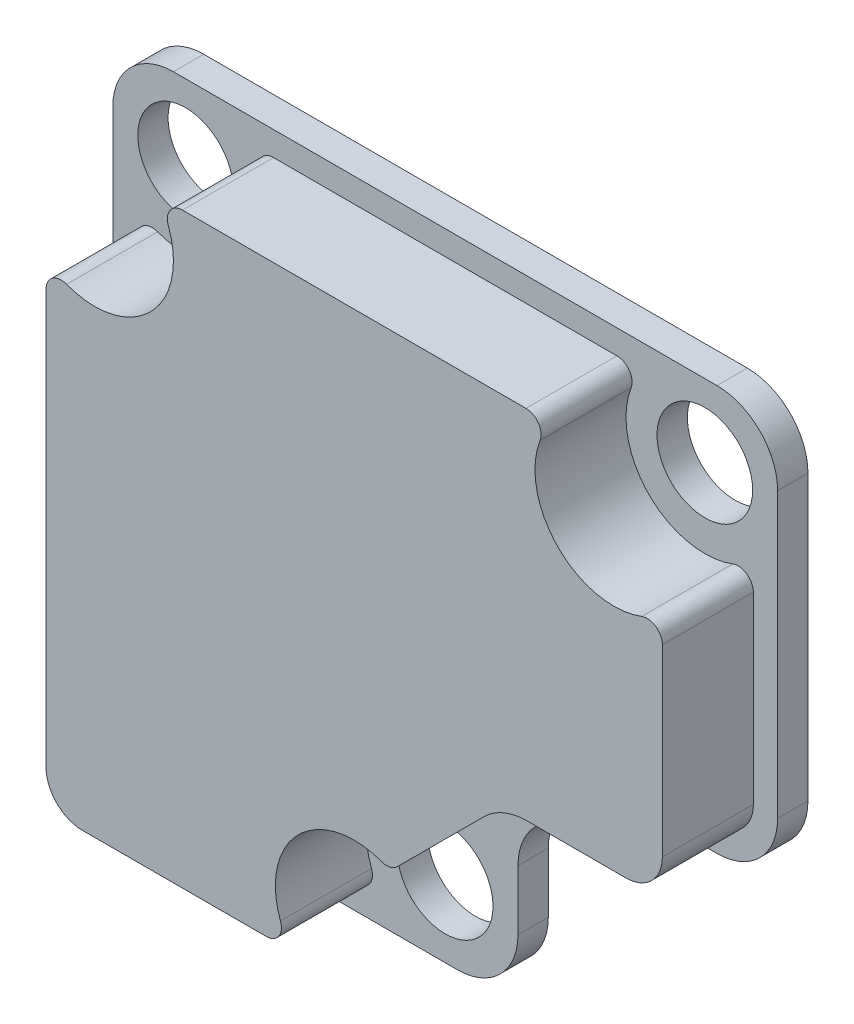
ISO-10303-21;
HEADER;
FILE_DESCRIPTION(('STEP AP214'),'2;1');
FILE_NAME('part.step','',(''),(''),'','','');
FILE_SCHEMA(('AUTOMOTIVE_DESIGN { 1 0 10303 214 1 1 1 1 }'));
ENDSEC;
DATA;
#1=APPLICATION_CONTEXT('core data for automotive mechanical design processes');
#2=APPLICATION_PROTOCOL_DEFINITION('international standard','automotive_design',2000,#1);
#3=PRODUCT_CONTEXT('',#1,'mechanical');
#4=PRODUCT('Part','Part','',(#3));
#5=PRODUCT_RELATED_PRODUCT_CATEGORY('part','',(#4));
#6=PRODUCT_DEFINITION_FORMATION('','',#4);
#7=PRODUCT_DEFINITION_CONTEXT('part definition',#1,'design');
#8=PRODUCT_DEFINITION('design','',#6,#7);
#9=PRODUCT_DEFINITION_SHAPE('','',#8);
#10=(LENGTH_UNIT() NAMED_UNIT(*) SI_UNIT(.MILLI.,.METRE.));
#11=(NAMED_UNIT(*) PLANE_ANGLE_UNIT() SI_UNIT($,.RADIAN.));
#12=(NAMED_UNIT(*) SI_UNIT($,.STERADIAN.) SOLID_ANGLE_UNIT());
#13=UNCERTAINTY_MEASURE_WITH_UNIT(LENGTH_MEASURE(1.E-05),#10,'distance_accuracy_value','');
#14=(GEOMETRIC_REPRESENTATION_CONTEXT(3) GLOBAL_UNCERTAINTY_ASSIGNED_CONTEXT((#13)) GLOBAL_UNIT_ASSIGNED_CONTEXT((#10,
#11,#12)) REPRESENTATION_CONTEXT('',''));
#15=CARTESIAN_POINT('',(0.,0.,0.));
#16=DIRECTION('',(0.,0.,1.));
#17=DIRECTION('',(1.,0.,0.));
#18=AXIS2_PLACEMENT_3D('',#15,#16,#17);
#19=CARTESIAN_POINT('',(0.,0.,0.));
#20=DIRECTION('',(0.,0.,-1.));
#21=DIRECTION('',(-1.,0.,0.));
#22=AXIS2_PLACEMENT_3D('',#19,#20,#21);
#23=PLANE('',#22);
#24=CARTESIAN_POINT('',(34.798,7.62,0.));
#25=DIRECTION('',(0.,0.,1.));
#26=DIRECTION('',(1.,0.,0.));
#27=AXIS2_PLACEMENT_3D('',#24,#25,#26);
#28=CIRCLE('',#27,5.0038);
#29=CARTESIAN_POINT('',(39.8018,7.62,0.));
#30=VERTEX_POINT('',#29);
#31=EDGE_CURVE('E874',#30,#30,#28,.T.);
#32=ORIENTED_EDGE('',*,*,#31,.T.);
#33=EDGE_LOOP('',(#32));
#34=FACE_BOUND('',#33,.T.);
#35=CARTESIAN_POINT('',(7.62,58.928,0.));
#36=DIRECTION('',(0.,0.,1.));
#37=DIRECTION('',(1.,0.,0.));
#38=AXIS2_PLACEMENT_3D('',#35,#36,#37);
#39=CIRCLE('',#38,5.0038);
#40=CARTESIAN_POINT('',(12.6238,58.928,0.));
#41=VERTEX_POINT('',#40);
#42=EDGE_CURVE('E880',#41,#41,#39,.T.);
#43=ORIENTED_EDGE('',*,*,#42,.T.);
#44=EDGE_LOOP('',(#43));
#45=FACE_BOUND('',#44,.T.);
#46=CARTESIAN_POINT('',(61.976,58.928,0.));
#47=DIRECTION('',(0.,0.,1.));
#48=DIRECTION('',(1.,0.,0.));
#49=AXIS2_PLACEMENT_3D('',#46,#47,#48);
#50=CIRCLE('',#49,5.0038);
#51=CARTESIAN_POINT('',(66.9798,58.928,0.));
#52=VERTEX_POINT('',#51);
#53=EDGE_CURVE('E877',#52,#52,#50,.T.);
#54=ORIENTED_EDGE('',*,*,#53,.T.);
#55=EDGE_LOOP('',(#54));
#56=FACE_BOUND('',#55,.T.);
#57=DIRECTION('',(1.,0.,0.));
#58=VECTOR('',#57,1.);
#59=CARTESIAN_POINT('',(0.,0.,0.));
#60=LINE('',#59,#58);
#61=CARTESIAN_POINT('',(6.35,0.,0.));
#62=VERTEX_POINT('',#61);
#63=CARTESIAN_POINT('',(36.068,0.,0.));
#64=VERTEX_POINT('',#63);
#65=EDGE_CURVE('E886',#62,#64,#60,.T.);
#66=ORIENTED_EDGE('',*,*,#65,.F.);
#67=CARTESIAN_POINT('',(6.35,6.35,0.));
#68=DIRECTION('',(0.,0.,-1.));
#69=DIRECTION('',(-1.,0.,0.));
#70=AXIS2_PLACEMENT_3D('',#67,#68,#69);
#71=CIRCLE('',#70,6.35);
#72=CARTESIAN_POINT('',(0.,6.35,0.));
#73=VERTEX_POINT('',#72);
#74=EDGE_CURVE('E926',#62,#73,#71,.T.);
#75=ORIENTED_EDGE('',*,*,#74,.T.);
#76=DIRECTION('',(0.,-1.,0.));
#77=VECTOR('',#76,1.);
#78=CARTESIAN_POINT('',(0.,0.,0.));
#79=LINE('',#78,#77);
#80=CARTESIAN_POINT('',(0.,60.198,0.));
#81=VERTEX_POINT('',#80);
#82=EDGE_CURVE('E883',#81,#73,#79,.T.);
#83=ORIENTED_EDGE('',*,*,#82,.F.);
#84=CARTESIAN_POINT('',(6.35,60.198,0.));
#85=DIRECTION('',(0.,0.,-1.));
#86=DIRECTION('',(-1.,0.,0.));
#87=AXIS2_PLACEMENT_3D('',#84,#85,#86);
#88=CIRCLE('',#87,6.35);
#89=CARTESIAN_POINT('',(6.35,66.548,0.));
#90=VERTEX_POINT('',#89);
#91=EDGE_CURVE('E918',#81,#90,#88,.T.);
#92=ORIENTED_EDGE('',*,*,#91,.T.);
#93=DIRECTION('',(-1.,0.,0.));
#94=VECTOR('',#93,1.);
#95=CARTESIAN_POINT('',(0.,66.548,0.));
#96=LINE('',#95,#94);
#97=CARTESIAN_POINT('',(63.246,66.548,0.));
#98=VERTEX_POINT('',#97);
#99=EDGE_CURVE('E892',#98,#90,#96,.T.);
#100=ORIENTED_EDGE('',*,*,#99,.F.);
#101=CARTESIAN_POINT('',(63.246,60.198,0.));
#102=DIRECTION('',(0.,0.,-1.));
#103=DIRECTION('',(-1.,0.,0.));
#104=AXIS2_PLACEMENT_3D('',#101,#102,#103);
#105=CIRCLE('',#104,6.35);
#106=CARTESIAN_POINT('',(69.596,60.198,0.));
#107=VERTEX_POINT('',#106);
#108=EDGE_CURVE('E920',#98,#107,#105,.T.);
#109=ORIENTED_EDGE('',*,*,#108,.T.);
#110=DIRECTION('',(0.,1.,0.));
#111=VECTOR('',#110,1.);
#112=CARTESIAN_POINT('',(69.596,0.,0.));
#113=LINE('',#112,#111);
#114=CARTESIAN_POINT('',(69.596,30.48,0.));
#115=VERTEX_POINT('',#114);
#116=EDGE_CURVE('E889',#115,#107,#113,.T.);
#117=ORIENTED_EDGE('',*,*,#116,.F.);
#118=CARTESIAN_POINT('',(63.246,30.48,0.));
#119=DIRECTION('',(0.,0.,-1.));
#120=DIRECTION('',(-1.,0.,0.));
#121=AXIS2_PLACEMENT_3D('',#118,#119,#120);
#122=CIRCLE('',#121,6.35);
#123=CARTESIAN_POINT('',(63.246,24.13,0.));
#124=VERTEX_POINT('',#123);
#125=EDGE_CURVE('E922',#115,#124,#122,.T.);
#126=ORIENTED_EDGE('',*,*,#125,.T.);
#127=DIRECTION('',(1.,0.,0.));
#128=VECTOR('',#127,1.);
#129=CARTESIAN_POINT('',(0.,24.13,0.));
#130=LINE('',#129,#128);
#131=CARTESIAN_POINT('',(53.938256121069,24.13,0.));
#132=VERTEX_POINT('',#131);
#133=EDGE_CURVE('E836',#132,#124,#130,.T.);
#134=ORIENTED_EDGE('',*,*,#133,.F.);
#135=CARTESIAN_POINT('',(53.938256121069,17.78,0.));
#136=DIRECTION('',(0.,0.,-1.));
#137=DIRECTION('',(-1.,0.,0.));
#138=AXIS2_PLACEMENT_3D('',#135,#136,#137);
#139=CIRCLE('',#138,6.35);
#140=CARTESIAN_POINT('',(49.4481280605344,22.2701280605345,0.));
#141=VERTEX_POINT('',#140);
#142=EDGE_CURVE('E911',#132,#141,#139,.F.);
#143=ORIENTED_EDGE('',*,*,#142,.T.);
#144=DIRECTION('',(0.707106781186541,0.707106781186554,0.));
#145=VECTOR('',#144,1.);
#146=CARTESIAN_POINT('',(13.5890000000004,-13.5890000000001,0.));
#147=LINE('',#146,#145);
#148=CARTESIAN_POINT('',(44.2778719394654,17.0998719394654,0.));
#149=VERTEX_POINT('',#148);
#150=EDGE_CURVE('E895',#149,#141,#147,.T.);
#151=ORIENTED_EDGE('',*,*,#150,.F.);
#152=CARTESIAN_POINT('',(48.768,12.6097438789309,0.));
#153=DIRECTION('',(0.,0.,-1.));
#154=DIRECTION('',(-1.,0.,0.));
#155=AXIS2_PLACEMENT_3D('',#152,#153,#154);
#156=CIRCLE('',#155,6.35);
#157=CARTESIAN_POINT('',(42.418,12.6097438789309,0.));
#158=VERTEX_POINT('',#157);
#159=EDGE_CURVE('E908',#149,#158,#156,.F.);
#160=ORIENTED_EDGE('',*,*,#159,.T.);
#161=DIRECTION('',(0.,1.,0.));
#162=VECTOR('',#161,1.);
#163=CARTESIAN_POINT('',(42.418,0.,0.));
#164=LINE('',#163,#162);
#165=CARTESIAN_POINT('',(42.418,6.35,0.));
#166=VERTEX_POINT('',#165);
#167=EDGE_CURVE('E872',#166,#158,#164,.T.);
#168=ORIENTED_EDGE('',*,*,#167,.F.);
#169=CARTESIAN_POINT('',(36.068,6.35,0.));
#170=DIRECTION('',(0.,0.,-1.));
#171=DIRECTION('',(-1.,0.,0.));
#172=AXIS2_PLACEMENT_3D('',#169,#170,#171);
#173=CIRCLE('',#172,6.35);
#174=EDGE_CURVE('E924',#166,#64,#173,.T.);
#175=ORIENTED_EDGE('',*,*,#174,.T.);
#176=EDGE_LOOP('',(#66,#75,#83,#92,#100,#109,#117,#126,#134,#143,#151,#160,#168,#175));
#177=FACE_BOUND('',#176,.T.);
#178=CARTESIAN_POINT('',(9.8425,44.1719334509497,0.));
#179=DIRECTION('',(0.,0.,-1.));
#180=DIRECTION('',(-1.,0.,0.));
#181=AXIS2_PLACEMENT_3D('',#178,#179,#180);
#182=CIRCLE('',#181,7.9375);
#183=CARTESIAN_POINT('',(1.905,44.1719334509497,0.));
#184=VERTEX_POINT('',#183);
#185=CARTESIAN_POINT('',(8.66031914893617,52.0209050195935,0.));
#186=VERTEX_POINT('',#185);
#187=EDGE_CURVE('E470',#184,#186,#182,.T.);
#188=ORIENTED_EDGE('',*,*,#187,.F.);
#189=DIRECTION('',(0.,1.,0.));
#190=VECTOR('',#189,1.);
#191=CARTESIAN_POINT('',(1.905,9.8425,0.));
#192=LINE('',#191,#190);
#193=CARTESIAN_POINT('',(1.905,9.8425,0.));
#194=VERTEX_POINT('',#193);
#195=EDGE_CURVE('E489',#194,#184,#192,.T.);
#196=ORIENTED_EDGE('',*,*,#195,.F.);
#197=CARTESIAN_POINT('',(9.8425,9.8425,0.));
#198=DIRECTION('',(0.,0.,-1.));
#199=DIRECTION('',(-1.,0.,0.));
#200=AXIS2_PLACEMENT_3D('',#197,#198,#199);
#201=CIRCLE('',#200,7.9375);
#202=CARTESIAN_POINT('',(9.8425,1.905,0.));
#203=VERTEX_POINT('',#202);
#204=EDGE_CURVE('E492',#203,#194,#201,.T.);
#205=ORIENTED_EDGE('',*,*,#204,.F.);
#206=DIRECTION('',(-1.,0.,0.));
#207=VECTOR('',#206,1.);
#208=CARTESIAN_POINT('',(20.0419334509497,1.905,0.));
#209=LINE('',#208,#207);
#210=CARTESIAN_POINT('',(20.0419334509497,1.905,0.));
#211=VERTEX_POINT('',#210);
#212=EDGE_CURVE('E580',#211,#203,#209,.T.);
#213=ORIENTED_EDGE('',*,*,#212,.F.);
#214=CARTESIAN_POINT('',(20.0419334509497,9.8425,0.));
#215=DIRECTION('',(0.,0.,-1.));
#216=DIRECTION('',(-1.,0.,0.));
#217=AXIS2_PLACEMENT_3D('',#214,#215,#216);
#218=CIRCLE('',#217,7.9375);
#219=CARTESIAN_POINT('',(27.8909050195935,8.66031914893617,0.));
#220=VERTEX_POINT('',#219);
#221=EDGE_CURVE('E577',#220,#211,#218,.T.);
#222=ORIENTED_EDGE('',*,*,#221,.F.);
#223=CARTESIAN_POINT('',(34.798,7.62,0.));
#224=DIRECTION('',(0.,0.,1.));
#225=DIRECTION('',(-1.,0.,0.));
#226=AXIS2_PLACEMENT_3D('',#223,#224,#225);
#227=CIRCLE('',#226,6.985);
#228=CARTESIAN_POINT('',(35.2527207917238,14.5901832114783,0.));
#229=VERTEX_POINT('',#228);
#230=EDGE_CURVE('E574',#229,#220,#227,.T.);
#231=ORIENTED_EDGE('',*,*,#230,.F.);
#232=CARTESIAN_POINT('',(35.7694489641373,22.5108459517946,0.));
#233=DIRECTION('',(0.,0.,-1.));
#234=DIRECTION('',(-1.,0.,0.));
#235=AXIS2_PLACEMENT_3D('',#232,#233,#234);
#236=CIRCLE('',#235,7.9375);
#237=CARTESIAN_POINT('',(41.3821090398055,16.8981858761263,0.));
#238=VERTEX_POINT('',#237);
#239=EDGE_CURVE('E571',#238,#229,#236,.T.);
#240=ORIENTED_EDGE('',*,*,#239,.F.);
#241=DIRECTION('',(-0.707106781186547,-0.707106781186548,0.));
#242=VECTOR('',#241,1.);
#243=CARTESIAN_POINT('',(41.3821090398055,16.8981858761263,0.));
#244=LINE('',#243,#242);
#245=CARTESIAN_POINT('',(48.1940832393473,23.7101600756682,0.));
#246=VERTEX_POINT('',#245);
#247=EDGE_CURVE('E568',#246,#238,#244,.T.);
#248=ORIENTED_EDGE('',*,*,#247,.F.);
#249=CARTESIAN_POINT('',(53.8067433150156,18.0975,0.));
#250=DIRECTION('',(0.,0.,1.));
#251=DIRECTION('',(-1.,0.,0.));
#252=AXIS2_PLACEMENT_3D('',#249,#250,#251);
#253=CIRCLE('',#252,7.9375);
#254=CARTESIAN_POINT('',(53.8067433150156,26.035,0.));
#255=VERTEX_POINT('',#254);
#256=EDGE_CURVE('E565',#255,#246,#253,.T.);
#257=ORIENTED_EDGE('',*,*,#256,.F.);
#258=DIRECTION('',(-1.,0.,0.));
#259=VECTOR('',#258,1.);
#260=CARTESIAN_POINT('',(53.8067433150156,26.035,0.));
#261=LINE('',#260,#259);
#262=CARTESIAN_POINT('',(59.7535,26.035,0.));
#263=VERTEX_POINT('',#262);
#264=EDGE_CURVE('E562',#263,#255,#261,.T.);
#265=ORIENTED_EDGE('',*,*,#264,.F.);
#266=CARTESIAN_POINT('',(59.7535,33.9725,0.));
#267=DIRECTION('',(0.,0.,-1.));
#268=DIRECTION('',(-1.,0.,0.));
#269=AXIS2_PLACEMENT_3D('',#266,#267,#268);
#270=CIRCLE('',#269,7.9375);
#271=CARTESIAN_POINT('',(67.691,33.9725,0.));
#272=VERTEX_POINT('',#271);
#273=EDGE_CURVE('E559',#272,#263,#270,.T.);
#274=ORIENTED_EDGE('',*,*,#273,.F.);
#275=DIRECTION('',(0.,-1.,0.));
#276=VECTOR('',#275,1.);
#277=CARTESIAN_POINT('',(67.691,33.9725,0.));
#278=LINE('',#277,#276);
#279=CARTESIAN_POINT('',(67.691,44.1719334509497,0.));
#280=VERTEX_POINT('',#279);
#281=EDGE_CURVE('E556',#280,#272,#278,.T.);
#282=ORIENTED_EDGE('',*,*,#281,.F.);
#283=CARTESIAN_POINT('',(59.7535,44.1719334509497,0.));
#284=DIRECTION('',(0.,0.,-1.));
#285=DIRECTION('',(-1.,0.,0.));
#286=AXIS2_PLACEMENT_3D('',#283,#284,#285);
#287=CIRCLE('',#286,7.9375);
#288=CARTESIAN_POINT('',(60.9356808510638,52.0209050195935,0.));
#289=VERTEX_POINT('',#288);
#290=EDGE_CURVE('E553',#289,#280,#287,.T.);
#291=ORIENTED_EDGE('',*,*,#290,.F.);
#292=CARTESIAN_POINT('',(61.976,58.928,0.));
#293=DIRECTION('',(0.,0.,1.));
#294=DIRECTION('',(-1.,0.,0.));
#295=AXIS2_PLACEMENT_3D('',#292,#293,#294);
#296=CIRCLE('',#295,6.985);
#297=CARTESIAN_POINT('',(55.0689050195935,57.8876808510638,0.));
#298=VERTEX_POINT('',#297);
#299=EDGE_CURVE('E550',#298,#289,#296,.T.);
#300=ORIENTED_EDGE('',*,*,#299,.F.);
#301=CARTESIAN_POINT('',(47.2199334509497,56.7055,0.));
#302=DIRECTION('',(0.,0.,-1.));
#303=DIRECTION('',(-1.,0.,0.));
#304=AXIS2_PLACEMENT_3D('',#301,#302,#303);
#305=CIRCLE('',#304,7.9375);
#306=CARTESIAN_POINT('',(47.2199334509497,64.643,0.));
#307=VERTEX_POINT('',#306);
#308=EDGE_CURVE('E547',#307,#298,#305,.T.);
#309=ORIENTED_EDGE('',*,*,#308,.F.);
#310=DIRECTION('',(1.,0.,0.));
#311=VECTOR('',#310,1.);
#312=CARTESIAN_POINT('',(47.2199334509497,64.643,0.));
#313=LINE('',#312,#311);
#314=CARTESIAN_POINT('',(22.3760665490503,64.643,0.));
#315=VERTEX_POINT('',#314);
#316=EDGE_CURVE('E544',#315,#307,#313,.T.);
#317=ORIENTED_EDGE('',*,*,#316,.F.);
#318=CARTESIAN_POINT('',(22.3760665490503,56.7055,0.));
#319=DIRECTION('',(0.,0.,-1.));
#320=DIRECTION('',(-1.,0.,0.));
#321=AXIS2_PLACEMENT_3D('',#318,#319,#320);
#322=CIRCLE('',#321,7.93750000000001);
#323=CARTESIAN_POINT('',(14.5270949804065,57.8876808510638,0.));
#324=VERTEX_POINT('',#323);
#325=EDGE_CURVE('E541',#324,#315,#322,.T.);
#326=ORIENTED_EDGE('',*,*,#325,.F.);
#327=CARTESIAN_POINT('',(7.62,58.928,0.));
#328=DIRECTION('',(0.,0.,1.));
#329=DIRECTION('',(-1.,0.,0.));
#330=AXIS2_PLACEMENT_3D('',#327,#328,#329);
#331=CIRCLE('',#330,6.985);
#332=EDGE_CURVE('E539',#186,#324,#331,.T.);
#333=ORIENTED_EDGE('',*,*,#332,.F.);
#334=EDGE_LOOP('',(#188,#196,#205,#213,#222,#231,#240,#248,#257,#265,#274,#282,#291,#300,#309,
#317,#326,#333));
#335=FACE_BOUND('',#334,.T.);
#336=ADVANCED_FACE('F38',(#34,#45,#56,#177,#335),#23,.T.);
#337=CARTESIAN_POINT('',(0.,0.,12.7));
#338=DIRECTION('',(1.,0.,0.));
#339=DIRECTION('',(0.,0.,-1.));
#340=AXIS2_PLACEMENT_3D('',#337,#338,#339);
#341=PLANE('',#340);
#342=DIRECTION('',(0.,-1.,0.));
#343=VECTOR('',#342,1.);
#344=CARTESIAN_POINT('',(0.,60.198,3.175));
#345=LINE('',#344,#343);
#346=CARTESIAN_POINT('',(0.,60.198,3.175));
#347=VERTEX_POINT('',#346);
#348=CARTESIAN_POINT('',(0.,6.35,3.175));
#349=VERTEX_POINT('',#348);
#350=EDGE_CURVE('E768',#347,#349,#345,.T.);
#351=ORIENTED_EDGE('',*,*,#350,.F.);
#352=DIRECTION('',(0.,0.,-1.));
#353=VECTOR('',#352,1.);
#354=CARTESIAN_POINT('',(0.,60.198,12.7));
#355=LINE('',#354,#353);
#356=EDGE_CURVE('E928',#347,#81,#355,.T.);
#357=ORIENTED_EDGE('',*,*,#356,.T.);
#358=ORIENTED_EDGE('',*,*,#82,.T.);
#359=DIRECTION('',(0.,0.,-1.));
#360=VECTOR('',#359,1.);
#361=CARTESIAN_POINT('',(0.,6.35,12.7));
#362=LINE('',#361,#360);
#363=EDGE_CURVE('E930',#73,#349,#362,.F.);
#364=ORIENTED_EDGE('',*,*,#363,.T.);
#365=EDGE_LOOP('',(#351,#357,#358,#364));
#366=FACE_BOUND('',#365,.T.);
#367=ADVANCED_FACE('F1086',(#366),#341,.F.);
#368=CARTESIAN_POINT('',(0.,0.,12.7));
#369=DIRECTION('',(0.,1.,0.));
#370=DIRECTION('',(0.,0.,1.));
#371=AXIS2_PLACEMENT_3D('',#368,#369,#370);
#372=PLANE('',#371);
#373=DIRECTION('',(1.,0.,0.));
#374=VECTOR('',#373,1.);
#375=CARTESIAN_POINT('',(6.35,0.,3.175));
#376=LINE('',#375,#374);
#377=CARTESIAN_POINT('',(6.35,0.,3.175));
#378=VERTEX_POINT('',#377);
#379=CARTESIAN_POINT('',(36.068,0.,3.175));
#380=VERTEX_POINT('',#379);
#381=EDGE_CURVE('E744',#378,#380,#376,.T.);
#382=ORIENTED_EDGE('',*,*,#381,.F.);
#383=DIRECTION('',(0.,0.,-1.));
#384=VECTOR('',#383,1.);
#385=CARTESIAN_POINT('',(6.35,0.,12.7));
#386=LINE('',#385,#384);
#387=EDGE_CURVE('E916',#378,#62,#386,.T.);
#388=ORIENTED_EDGE('',*,*,#387,.T.);
#389=ORIENTED_EDGE('',*,*,#65,.T.);
#390=DIRECTION('',(0.,0.,1.));
#391=VECTOR('',#390,1.);
#392=CARTESIAN_POINT('',(36.068,0.,12.7));
#393=LINE('',#392,#391);
#394=EDGE_CURVE('E913',#64,#380,#393,.T.);
#395=ORIENTED_EDGE('',*,*,#394,.T.);
#396=EDGE_LOOP('',(#382,#388,#389,#395));
#397=FACE_BOUND('',#396,.T.);
#398=ADVANCED_FACE('F1093',(#397),#372,.F.);
#399=CARTESIAN_POINT('',(69.596,0.,12.7));
#400=DIRECTION('',(-1.,0.,0.));
#401=DIRECTION('',(0.,0.,1.));
#402=AXIS2_PLACEMENT_3D('',#399,#400,#401);
#403=PLANE('',#402);
#404=DIRECTION('',(0.,1.,0.));
#405=VECTOR('',#404,1.);
#406=CARTESIAN_POINT('',(69.596,30.48,3.175));
#407=LINE('',#406,#405);
#408=CARTESIAN_POINT('',(69.596,30.4799999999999,3.175));
#409=VERTEX_POINT('',#408);
#410=CARTESIAN_POINT('',(69.596,60.198,3.175));
#411=VERTEX_POINT('',#410);
#412=EDGE_CURVE('E760',#409,#411,#407,.T.);
#413=ORIENTED_EDGE('',*,*,#412,.F.);
#414=DIRECTION('',(0.,0.,-1.));
#415=VECTOR('',#414,1.);
#416=CARTESIAN_POINT('',(69.596,30.48,12.7));
#417=LINE('',#416,#415);
#418=EDGE_CURVE('E938',#409,#115,#417,.T.);
#419=ORIENTED_EDGE('',*,*,#418,.T.);
#420=ORIENTED_EDGE('',*,*,#116,.T.);
#421=DIRECTION('',(0.,0.,-1.));
#422=VECTOR('',#421,1.);
#423=CARTESIAN_POINT('',(69.596,60.198,12.7));
#424=LINE('',#423,#422);
#425=EDGE_CURVE('E935',#107,#411,#424,.F.);
#426=ORIENTED_EDGE('',*,*,#425,.T.);
#427=EDGE_LOOP('',(#413,#419,#420,#426));
#428=FACE_BOUND('',#427,.T.);
#429=ADVANCED_FACE('F1104',(#428),#403,.F.);
#430=CARTESIAN_POINT('',(0.,66.548,12.7));
#431=DIRECTION('',(0.,-1.,0.));
#432=DIRECTION('',(0.,0.,-1.));
#433=AXIS2_PLACEMENT_3D('',#430,#431,#432);
#434=PLANE('',#433);
#435=DIRECTION('',(-1.,0.,0.));
#436=VECTOR('',#435,1.);
#437=CARTESIAN_POINT('',(63.246,66.548,3.175));
#438=LINE('',#437,#436);
#439=CARTESIAN_POINT('',(63.246,66.548,3.175));
#440=VERTEX_POINT('',#439);
#441=CARTESIAN_POINT('',(6.35,66.548,3.175));
#442=VERTEX_POINT('',#441);
#443=EDGE_CURVE('E764',#440,#442,#438,.T.);
#444=ORIENTED_EDGE('',*,*,#443,.F.);
#445=DIRECTION('',(0.,0.,-1.));
#446=VECTOR('',#445,1.);
#447=CARTESIAN_POINT('',(63.246,66.548,12.7));
#448=LINE('',#447,#446);
#449=EDGE_CURVE('E946',#440,#98,#448,.T.);
#450=ORIENTED_EDGE('',*,*,#449,.T.);
#451=ORIENTED_EDGE('',*,*,#99,.T.);
#452=DIRECTION('',(0.,0.,-1.));
#453=VECTOR('',#452,1.);
#454=CARTESIAN_POINT('',(6.35,66.548,12.7));
#455=LINE('',#454,#453);
#456=EDGE_CURVE('E943',#90,#442,#455,.F.);
#457=ORIENTED_EDGE('',*,*,#456,.T.);
#458=EDGE_LOOP('',(#444,#450,#451,#457));
#459=FACE_BOUND('',#458,.T.);
#460=ADVANCED_FACE('F1100',(#459),#434,.F.);
#461=CARTESIAN_POINT('',(7.62,58.928,12.7));
#462=DIRECTION('',(0.,0.,-1.));
#463=DIRECTION('',(-1.,0.,0.));
#464=AXIS2_PLACEMENT_3D('',#461,#462,#463);
#465=CYLINDRICAL_SURFACE('',#464,5.0038);
#466=ORIENTED_EDGE('',*,*,#42,.F.);
#467=EDGE_LOOP('',(#466));
#468=FACE_BOUND('',#467,.T.);
#469=CARTESIAN_POINT('',(7.62,58.928,3.175));
#470=DIRECTION('',(0.,0.,1.));
#471=DIRECTION('',(1.,0.,0.));
#472=AXIS2_PLACEMENT_3D('',#469,#470,#471);
#473=CIRCLE('',#472,5.0038);
#474=CARTESIAN_POINT('',(12.6238,58.928,3.175));
#475=VERTEX_POINT('',#474);
#476=EDGE_CURVE('E776',#475,#475,#473,.T.);
#477=ORIENTED_EDGE('',*,*,#476,.T.);
#478=EDGE_LOOP('',(#477));
#479=FACE_BOUND('',#478,.T.);
#480=ADVANCED_FACE('F1103',(#468,#479),#465,.F.);
#481=CARTESIAN_POINT('',(61.976,58.928,12.7));
#482=DIRECTION('',(0.,0.,-1.));
#483=DIRECTION('',(-1.,0.,0.));
#484=AXIS2_PLACEMENT_3D('',#481,#482,#483);
#485=CYLINDRICAL_SURFACE('',#484,5.0038);
#486=ORIENTED_EDGE('',*,*,#53,.F.);
#487=EDGE_LOOP('',(#486));
#488=FACE_BOUND('',#487,.T.);
#489=CARTESIAN_POINT('',(61.976,58.928,3.175));
#490=DIRECTION('',(0.,0.,1.));
#491=DIRECTION('',(1.,0.,0.));
#492=AXIS2_PLACEMENT_3D('',#489,#490,#491);
#493=CIRCLE('',#492,5.0038);
#494=CARTESIAN_POINT('',(66.9798,58.928,3.175));
#495=VERTEX_POINT('',#494);
#496=EDGE_CURVE('E773',#495,#495,#493,.T.);
#497=ORIENTED_EDGE('',*,*,#496,.T.);
#498=EDGE_LOOP('',(#497));
#499=FACE_BOUND('',#498,.T.);
#500=ADVANCED_FACE('F1707',(#488,#499),#485,.F.);
#501=CARTESIAN_POINT('',(34.798,7.62,12.7));
#502=DIRECTION('',(0.,0.,-1.));
#503=DIRECTION('',(-1.,0.,0.));
#504=AXIS2_PLACEMENT_3D('',#501,#502,#503);
#505=CYLINDRICAL_SURFACE('',#504,5.0038);
#506=ORIENTED_EDGE('',*,*,#31,.F.);
#507=EDGE_LOOP('',(#506));
#508=FACE_BOUND('',#507,.T.);
#509=CARTESIAN_POINT('',(34.798,7.62,3.175));
#510=DIRECTION('',(0.,0.,1.));
#511=DIRECTION('',(1.,0.,0.));
#512=AXIS2_PLACEMENT_3D('',#509,#510,#511);
#513=CIRCLE('',#512,5.0038);
#514=CARTESIAN_POINT('',(39.8018,7.62,3.175));
#515=VERTEX_POINT('',#514);
#516=EDGE_CURVE('E770',#515,#515,#513,.T.);
#517=ORIENTED_EDGE('',*,*,#516,.T.);
#518=EDGE_LOOP('',(#517));
#519=FACE_BOUND('',#518,.T.);
#520=ADVANCED_FACE('F1697',(#508,#519),#505,.F.);
#521=CARTESIAN_POINT('',(42.418,0.,-31.75));
#522=DIRECTION('',(-1.,0.,0.));
#523=DIRECTION('',(0.,0.,1.));
#524=AXIS2_PLACEMENT_3D('',#521,#522,#523);
#525=PLANE('',#524);
#526=DIRECTION('',(0.,1.,0.));
#527=VECTOR('',#526,1.);
#528=CARTESIAN_POINT('',(42.418,6.35,3.175));
#529=LINE('',#528,#527);
#530=CARTESIAN_POINT('',(42.418,6.35000000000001,3.175));
#531=VERTEX_POINT('',#530);
#532=CARTESIAN_POINT('',(42.418,12.6097438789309,3.175));
#533=VERTEX_POINT('',#532);
#534=EDGE_CURVE('E748',#531,#533,#529,.T.);
#535=ORIENTED_EDGE('',*,*,#534,.F.);
#536=DIRECTION('',(0.,0.,1.));
#537=VECTOR('',#536,1.);
#538=CARTESIAN_POINT('',(42.418,6.35,-31.75));
#539=LINE('',#538,#537);
#540=EDGE_CURVE('E933',#531,#166,#539,.F.);
#541=ORIENTED_EDGE('',*,*,#540,.T.);
#542=ORIENTED_EDGE('',*,*,#167,.T.);
#543=DIRECTION('',(0.,0.,1.));
#544=VECTOR('',#543,1.);
#545=CARTESIAN_POINT('',(42.418,12.6097438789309,12.7));
#546=LINE('',#545,#544);
#547=EDGE_CURVE('E898',#158,#533,#546,.T.);
#548=ORIENTED_EDGE('',*,*,#547,.T.);
#549=EDGE_LOOP('',(#535,#541,#542,#548));
#550=FACE_BOUND('',#549,.T.);
#551=ADVANCED_FACE('F1687',(#550),#525,.F.);
#552=CARTESIAN_POINT('',(51.3079999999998,24.13,-31.75));
#553=DIRECTION('',(-0.707106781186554,0.707106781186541,0.));
#554=DIRECTION('',(-0.707106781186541,-0.707106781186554,0.));
#555=AXIS2_PLACEMENT_3D('',#552,#553,#554);
#556=PLANE('',#555);
#557=DIRECTION('',(0.707106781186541,0.707106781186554,0.));
#558=VECTOR('',#557,1.);
#559=CARTESIAN_POINT('',(44.2778719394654,17.0998719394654,3.175));
#560=LINE('',#559,#558);
#561=CARTESIAN_POINT('',(44.2778719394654,17.0998719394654,3.175));
#562=VERTEX_POINT('',#561);
#563=CARTESIAN_POINT('',(49.4481280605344,22.2701280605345,3.175));
#564=VERTEX_POINT('',#563);
#565=EDGE_CURVE('E752',#562,#564,#560,.T.);
#566=ORIENTED_EDGE('',*,*,#565,.F.);
#567=DIRECTION('',(0.,0.,1.));
#568=VECTOR('',#567,1.);
#569=CARTESIAN_POINT('',(44.2778719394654,17.0998719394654,0.));
#570=LINE('',#569,#568);
#571=EDGE_CURVE('E904',#562,#149,#570,.F.);
#572=ORIENTED_EDGE('',*,*,#571,.T.);
#573=ORIENTED_EDGE('',*,*,#150,.T.);
#574=DIRECTION('',(0.,0.,1.));
#575=VECTOR('',#574,1.);
#576=CARTESIAN_POINT('',(49.4481280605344,22.2701280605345,12.7));
#577=LINE('',#576,#575);
#578=EDGE_CURVE('E901',#141,#564,#577,.T.);
#579=ORIENTED_EDGE('',*,*,#578,.T.);
#580=EDGE_LOOP('',(#566,#572,#573,#579));
#581=FACE_BOUND('',#580,.T.);
#582=ADVANCED_FACE('F1677',(#581),#556,.F.);
#583=CARTESIAN_POINT('',(69.596,24.13,-31.75));
#584=DIRECTION('',(0.,1.,0.));
#585=DIRECTION('',(-1.,0.,0.));
#586=AXIS2_PLACEMENT_3D('',#583,#584,#585);
#587=PLANE('',#586);
#588=DIRECTION('',(1.,0.,0.));
#589=VECTOR('',#588,1.);
#590=CARTESIAN_POINT('',(53.938256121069,24.13,3.175));
#591=LINE('',#590,#589);
#592=CARTESIAN_POINT('',(53.938256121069,24.13,3.175));
#593=VERTEX_POINT('',#592);
#594=CARTESIAN_POINT('',(63.2460000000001,24.13,3.175));
#595=VERTEX_POINT('',#594);
#596=EDGE_CURVE('E756',#593,#595,#591,.T.);
#597=ORIENTED_EDGE('',*,*,#596,.F.);
#598=DIRECTION('',(0.,0.,1.));
#599=VECTOR('',#598,1.);
#600=CARTESIAN_POINT('',(53.938256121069,24.13,0.));
#601=LINE('',#600,#599);
#602=EDGE_CURVE('E906',#593,#132,#601,.F.);
#603=ORIENTED_EDGE('',*,*,#602,.T.);
#604=ORIENTED_EDGE('',*,*,#133,.T.);
#605=DIRECTION('',(0.,0.,-1.));
#606=VECTOR('',#605,1.);
#607=CARTESIAN_POINT('',(63.246,24.13,-31.75));
#608=LINE('',#607,#606);
#609=EDGE_CURVE('E940',#124,#595,#608,.F.);
#610=ORIENTED_EDGE('',*,*,#609,.T.);
#611=EDGE_LOOP('',(#597,#603,#604,#610));
#612=FACE_BOUND('',#611,.T.);
#613=ADVANCED_FACE('F1116',(#612),#587,.F.);
#614=CARTESIAN_POINT('',(48.768,12.6097438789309,-31.75));
#615=DIRECTION('',(0.,0.,-1.));
#616=DIRECTION('',(-1.,0.,0.));
#617=AXIS2_PLACEMENT_3D('',#614,#615,#616);
#618=CYLINDRICAL_SURFACE('',#617,6.35);
#619=CARTESIAN_POINT('',(48.768,12.6097438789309,3.175));
#620=DIRECTION('',(0.,0.,-1.));
#621=DIRECTION('',(-1.,0.,0.));
#622=AXIS2_PLACEMENT_3D('',#619,#620,#621);
#623=CIRCLE('',#622,6.34999999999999);
#624=EDGE_CURVE('E750',#533,#562,#623,.T.);
#625=ORIENTED_EDGE('',*,*,#624,.F.);
#626=ORIENTED_EDGE('',*,*,#547,.F.);
#627=ORIENTED_EDGE('',*,*,#159,.F.);
#628=ORIENTED_EDGE('',*,*,#571,.F.);
#629=EDGE_LOOP('',(#625,#626,#627,#628));
#630=FACE_BOUND('',#629,.T.);
#631=ADVANCED_FACE('F1112',(#630),#618,.F.);
#632=CARTESIAN_POINT('',(53.938256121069,17.78,-31.75));
#633=DIRECTION('',(0.,0.,-1.));
#634=DIRECTION('',(-1.,0.,0.));
#635=AXIS2_PLACEMENT_3D('',#632,#633,#634);
#636=CYLINDRICAL_SURFACE('',#635,6.35);
#637=CARTESIAN_POINT('',(53.938256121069,17.78,3.175));
#638=DIRECTION('',(0.,0.,-1.));
#639=DIRECTION('',(-1.,0.,0.));
#640=AXIS2_PLACEMENT_3D('',#637,#638,#639);
#641=CIRCLE('',#640,6.35000000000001);
#642=EDGE_CURVE('E754',#564,#593,#641,.T.);
#643=ORIENTED_EDGE('',*,*,#642,.F.);
#644=ORIENTED_EDGE('',*,*,#578,.F.);
#645=ORIENTED_EDGE('',*,*,#142,.F.);
#646=ORIENTED_EDGE('',*,*,#602,.F.);
#647=EDGE_LOOP('',(#643,#644,#645,#646));
#648=FACE_BOUND('',#647,.T.);
#649=ADVANCED_FACE('F1115',(#648),#636,.F.);
#650=CARTESIAN_POINT('',(6.35,6.35,12.7));
#651=DIRECTION('',(0.,0.,-1.));
#652=DIRECTION('',(-1.,0.,0.));
#653=AXIS2_PLACEMENT_3D('',#650,#651,#652);
#654=CYLINDRICAL_SURFACE('',#653,6.35);
#655=ORIENTED_EDGE('',*,*,#387,.F.);
#656=CARTESIAN_POINT('',(6.35,6.35,3.175));
#657=DIRECTION('',(0.,0.,1.));
#658=DIRECTION('',(1.,0.,0.));
#659=AXIS2_PLACEMENT_3D('',#656,#657,#658);
#660=CIRCLE('',#659,6.35);
#661=EDGE_CURVE('E731',#349,#378,#660,.T.);
#662=ORIENTED_EDGE('',*,*,#661,.F.);
#663=ORIENTED_EDGE('',*,*,#363,.F.);
#664=ORIENTED_EDGE('',*,*,#74,.F.);
#665=EDGE_LOOP('',(#655,#662,#663,#664));
#666=FACE_BOUND('',#665,.T.);
#667=ADVANCED_FACE('F1120',(#666),#654,.T.);
#668=CARTESIAN_POINT('',(36.068,6.35,12.7));
#669=DIRECTION('',(0.,0.,1.));
#670=DIRECTION('',(1.,0.,0.));
#671=AXIS2_PLACEMENT_3D('',#668,#669,#670);
#672=CYLINDRICAL_SURFACE('',#671,6.35);
#673=ORIENTED_EDGE('',*,*,#540,.F.);
#674=CARTESIAN_POINT('',(36.068,6.35000000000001,3.175));
#675=DIRECTION('',(0.,0.,1.));
#676=DIRECTION('',(1.,0.,0.));
#677=AXIS2_PLACEMENT_3D('',#674,#675,#676);
#678=CIRCLE('',#677,6.35);
#679=EDGE_CURVE('E746',#380,#531,#678,.T.);
#680=ORIENTED_EDGE('',*,*,#679,.F.);
#681=ORIENTED_EDGE('',*,*,#394,.F.);
#682=ORIENTED_EDGE('',*,*,#174,.F.);
#683=EDGE_LOOP('',(#673,#680,#681,#682));
#684=FACE_BOUND('',#683,.T.);
#685=ADVANCED_FACE('F1124',(#684),#672,.T.);
#686=CARTESIAN_POINT('',(63.246,30.48,12.7));
#687=DIRECTION('',(0.,0.,-1.));
#688=DIRECTION('',(-1.,0.,0.));
#689=AXIS2_PLACEMENT_3D('',#686,#687,#688);
#690=CYLINDRICAL_SURFACE('',#689,6.35);
#691=ORIENTED_EDGE('',*,*,#418,.F.);
#692=CARTESIAN_POINT('',(63.2460000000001,30.4799999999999,3.175));
#693=DIRECTION('',(0.,0.,1.));
#694=DIRECTION('',(1.,0.,0.));
#695=AXIS2_PLACEMENT_3D('',#692,#693,#694);
#696=CIRCLE('',#695,6.34999999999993);
#697=EDGE_CURVE('E758',#595,#409,#696,.T.);
#698=ORIENTED_EDGE('',*,*,#697,.F.);
#699=ORIENTED_EDGE('',*,*,#609,.F.);
#700=ORIENTED_EDGE('',*,*,#125,.F.);
#701=EDGE_LOOP('',(#691,#698,#699,#700));
#702=FACE_BOUND('',#701,.T.);
#703=ADVANCED_FACE('F1128',(#702),#690,.T.);
#704=CARTESIAN_POINT('',(63.246,60.198,12.7));
#705=DIRECTION('',(0.,0.,-1.));
#706=DIRECTION('',(-1.,0.,0.));
#707=AXIS2_PLACEMENT_3D('',#704,#705,#706);
#708=CYLINDRICAL_SURFACE('',#707,6.35);
#709=ORIENTED_EDGE('',*,*,#449,.F.);
#710=CARTESIAN_POINT('',(63.246,60.198,3.175));
#711=DIRECTION('',(0.,0.,1.));
#712=DIRECTION('',(1.,0.,0.));
#713=AXIS2_PLACEMENT_3D('',#710,#711,#712);
#714=CIRCLE('',#713,6.35);
#715=EDGE_CURVE('E762',#411,#440,#714,.T.);
#716=ORIENTED_EDGE('',*,*,#715,.F.);
#717=ORIENTED_EDGE('',*,*,#425,.F.);
#718=ORIENTED_EDGE('',*,*,#108,.F.);
#719=EDGE_LOOP('',(#709,#716,#717,#718));
#720=FACE_BOUND('',#719,.T.);
#721=ADVANCED_FACE('F1132',(#720),#708,.T.);
#722=CARTESIAN_POINT('',(6.35,60.198,12.7));
#723=DIRECTION('',(0.,0.,-1.));
#724=DIRECTION('',(-1.,0.,0.));
#725=AXIS2_PLACEMENT_3D('',#722,#723,#724);
#726=CYLINDRICAL_SURFACE('',#725,6.35);
#727=ORIENTED_EDGE('',*,*,#356,.F.);
#728=CARTESIAN_POINT('',(6.35,60.198,3.175));
#729=DIRECTION('',(0.,0.,1.));
#730=DIRECTION('',(1.,0.,0.));
#731=AXIS2_PLACEMENT_3D('',#728,#729,#730);
#732=CIRCLE('',#731,6.35);
#733=EDGE_CURVE('E766',#442,#347,#732,.T.);
#734=ORIENTED_EDGE('',*,*,#733,.F.);
#735=ORIENTED_EDGE('',*,*,#456,.F.);
#736=ORIENTED_EDGE('',*,*,#91,.F.);
#737=EDGE_LOOP('',(#727,#734,#735,#736));
#738=FACE_BOUND('',#737,.T.);
#739=ADVANCED_FACE('F1136',(#738),#726,.T.);
#740=CARTESIAN_POINT('',(6.35,6.35,3.175));
#741=DIRECTION('',(0.,0.,1.));
#742=DIRECTION('',(1.,0.,0.));
#743=AXIS2_PLACEMENT_3D('',#740,#741,#742);
#744=PLANE('',#743);
#745=ORIENTED_EDGE('',*,*,#476,.F.);
#746=EDGE_LOOP('',(#745));
#747=FACE_BOUND('',#746,.T.);
#748=ORIENTED_EDGE('',*,*,#496,.F.);
#749=EDGE_LOOP('',(#748));
#750=FACE_BOUND('',#749,.T.);
#751=ORIENTED_EDGE('',*,*,#516,.F.);
#752=EDGE_LOOP('',(#751));
#753=FACE_BOUND('',#752,.T.);
#754=DIRECTION('',(-1.,0.,0.));
#755=VECTOR('',#754,1.);
#756=CARTESIAN_POINT('',(14.1268137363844,64.008,3.175));
#757=LINE('',#756,#755);
#758=CARTESIAN_POINT('',(52.7739757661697,64.008,3.175));
#759=VERTEX_POINT('',#758);
#760=CARTESIAN_POINT('',(16.8220242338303,64.008,3.175));
#761=VERTEX_POINT('',#760);
#762=EDGE_CURVE('E693',#759,#761,#757,.T.);
#763=ORIENTED_EDGE('',*,*,#762,.F.);
#764=CARTESIAN_POINT('',(52.7739757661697,62.4205,3.175));
#765=DIRECTION('',(0.,0.,1.));
#766=DIRECTION('',(1.,0.,0.));
#767=AXIS2_PLACEMENT_3D('',#764,#765,#766);
#768=CIRCLE('',#767,1.5875);
#769=CARTESIAN_POINT('',(54.2581732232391,61.8571935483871,3.175));
#770=VERTEX_POINT('',#769);
#771=EDGE_CURVE('E993',#759,#770,#768,.F.);
#772=ORIENTED_EDGE('',*,*,#771,.T.);
#773=CARTESIAN_POINT('',(61.976,58.928,3.175));
#774=DIRECTION('',(0.,0.,-1.));
#775=DIRECTION('',(1.,0.,0.));
#776=AXIS2_PLACEMENT_3D('',#773,#774,#775);
#777=CIRCLE('',#776,8.255);
#778=CARTESIAN_POINT('',(64.9051935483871,51.2101732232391,3.175));
#779=VERTEX_POINT('',#778);
#780=EDGE_CURVE('E690',#779,#770,#777,.T.);
#781=ORIENTED_EDGE('',*,*,#780,.F.);
#782=CARTESIAN_POINT('',(65.4685,49.7259757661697,3.175));
#783=DIRECTION('',(0.,0.,1.));
#784=DIRECTION('',(1.,0.,0.));
#785=AXIS2_PLACEMENT_3D('',#782,#783,#784);
#786=CIRCLE('',#785,1.5875);
#787=CARTESIAN_POINT('',(67.056,49.7259757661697,3.175));
#788=VERTEX_POINT('',#787);
#789=EDGE_CURVE('E991',#779,#788,#786,.F.);
#790=ORIENTED_EDGE('',*,*,#789,.T.);
#791=DIRECTION('',(0.,1.,0.));
#792=VECTOR('',#791,1.);
#793=CARTESIAN_POINT('',(67.056,52.4211862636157,3.175));
#794=LINE('',#793,#792);
#795=CARTESIAN_POINT('',(67.056,30.48,3.175));
#796=VERTEX_POINT('',#795);
#797=EDGE_CURVE('E687',#796,#788,#794,.T.);
#798=ORIENTED_EDGE('',*,*,#797,.F.);
#799=CARTESIAN_POINT('',(63.246,30.48,3.175));
#800=DIRECTION('',(0.,0.,1.));
#801=DIRECTION('',(-1.,0.,0.));
#802=AXIS2_PLACEMENT_3D('',#799,#800,#801);
#803=CIRCLE('',#802,3.81);
#804=CARTESIAN_POINT('',(63.246,26.67,3.175));
#805=VERTEX_POINT('',#804);
#806=EDGE_CURVE('E684',#805,#796,#803,.T.);
#807=ORIENTED_EDGE('',*,*,#806,.F.);
#808=DIRECTION('',(1.,0.,0.));
#809=VECTOR('',#808,1.);
#810=CARTESIAN_POINT('',(63.246,26.67,3.175));
#811=LINE('',#810,#809);
#812=CARTESIAN_POINT('',(52.8861536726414,26.67,3.175));
#813=VERTEX_POINT('',#812);
#814=EDGE_CURVE('E681',#813,#805,#811,.T.);
#815=ORIENTED_EDGE('',*,*,#814,.F.);
#816=CARTESIAN_POINT('',(52.8861536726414,20.32,3.175));
#817=DIRECTION('',(0.,0.,-1.));
#818=DIRECTION('',(1.,0.,0.));
#819=AXIS2_PLACEMENT_3D('',#816,#817,#818);
#820=CIRCLE('',#819,6.35);
#821=CARTESIAN_POINT('',(48.3960256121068,24.8101280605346,3.175));
#822=VERTEX_POINT('',#821);
#823=EDGE_CURVE('E678',#822,#813,#820,.T.);
#824=ORIENTED_EDGE('',*,*,#823,.F.);
#825=DIRECTION('',(0.707106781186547,0.707106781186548,0.));
#826=VECTOR('',#825,1.);
#827=CARTESIAN_POINT('',(48.3960256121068,24.8101280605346,3.175));
#828=LINE('',#827,#826);
#829=CARTESIAN_POINT('',(39.3201190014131,15.7342214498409,3.175));
#830=VERTEX_POINT('',#829);
#831=EDGE_CURVE('E676',#830,#822,#828,.T.);
#832=ORIENTED_EDGE('',*,*,#831,.F.);
#833=CARTESIAN_POINT('',(38.1975869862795,16.8567534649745,3.175));
#834=DIRECTION('',(0.,0.,1.));
#835=DIRECTION('',(1.,0.,0.));
#836=AXIS2_PLACEMENT_3D('',#833,#834,#835);
#837=CIRCLE('',#836,1.5875);
#838=CARTESIAN_POINT('',(37.6492665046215,15.3669545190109,3.175));
#839=VERTEX_POINT('',#838);
#840=EDGE_CURVE('E995',#830,#839,#837,.F.);
#841=ORIENTED_EDGE('',*,*,#840,.T.);
#842=CARTESIAN_POINT('',(34.798,7.62,3.175));
#843=DIRECTION('',(0.,0.,-1.));
#844=DIRECTION('',(1.,0.,0.));
#845=AXIS2_PLACEMENT_3D('',#842,#843,#844);
#846=CIRCLE('',#845,8.255);
#847=CARTESIAN_POINT('',(27.0801732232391,4.6908064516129,3.175));
#848=VERTEX_POINT('',#847);
#849=EDGE_CURVE('E673',#848,#839,#846,.T.);
#850=ORIENTED_EDGE('',*,*,#849,.F.);
#851=CARTESIAN_POINT('',(25.5959757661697,4.1275,3.175));
#852=DIRECTION('',(0.,0.,1.));
#853=DIRECTION('',(1.,0.,0.));
#854=AXIS2_PLACEMENT_3D('',#851,#852,#853);
#855=CIRCLE('',#854,1.5875);
#856=CARTESIAN_POINT('',(25.5959757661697,2.54,3.175));
#857=VERTEX_POINT('',#856);
#858=EDGE_CURVE('E997',#848,#857,#855,.F.);
#859=ORIENTED_EDGE('',*,*,#858,.T.);
#860=DIRECTION('',(1.,0.,0.));
#861=VECTOR('',#860,1.);
#862=CARTESIAN_POINT('',(6.35,2.54,3.175));
#863=LINE('',#862,#861);
#864=CARTESIAN_POINT('',(6.35,2.54,3.175));
#865=VERTEX_POINT('',#864);
#866=EDGE_CURVE('E670',#865,#857,#863,.T.);
#867=ORIENTED_EDGE('',*,*,#866,.F.);
#868=CARTESIAN_POINT('',(6.35,6.34999999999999,3.175));
#869=DIRECTION('',(0.,0.,1.));
#870=DIRECTION('',(1.,0.,0.));
#871=AXIS2_PLACEMENT_3D('',#868,#869,#870);
#872=CIRCLE('',#871,3.80999999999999);
#873=CARTESIAN_POINT('',(2.54000000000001,6.35,3.175));
#874=VERTEX_POINT('',#873);
#875=EDGE_CURVE('E667',#874,#865,#872,.T.);
#876=ORIENTED_EDGE('',*,*,#875,.F.);
#877=DIRECTION('',(0.,-1.,0.));
#878=VECTOR('',#877,1.);
#879=CARTESIAN_POINT('',(2.54,52.4211862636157,3.175));
#880=LINE('',#879,#878);
#881=CARTESIAN_POINT('',(2.54,49.7259757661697,3.175));
#882=VERTEX_POINT('',#881);
#883=EDGE_CURVE('E664',#882,#874,#880,.T.);
#884=ORIENTED_EDGE('',*,*,#883,.F.);
#885=CARTESIAN_POINT('',(4.1275,49.7259757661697,3.175));
#886=DIRECTION('',(0.,0.,1.));
#887=DIRECTION('',(1.,0.,0.));
#888=AXIS2_PLACEMENT_3D('',#885,#886,#887);
#889=CIRCLE('',#888,1.5875);
#890=CARTESIAN_POINT('',(4.6908064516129,51.2101732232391,3.175));
#891=VERTEX_POINT('',#890);
#892=EDGE_CURVE('E46',#882,#891,#889,.F.);
#893=ORIENTED_EDGE('',*,*,#892,.T.);
#894=CARTESIAN_POINT('',(7.62,58.928,3.175));
#895=DIRECTION('',(0.,0.,-1.));
#896=DIRECTION('',(1.,0.,0.));
#897=AXIS2_PLACEMENT_3D('',#894,#895,#896);
#898=CIRCLE('',#897,8.255);
#899=CARTESIAN_POINT('',(15.3378267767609,61.8571935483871,3.175));
#900=VERTEX_POINT('',#899);
#901=EDGE_CURVE('E662',#900,#891,#898,.T.);
#902=ORIENTED_EDGE('',*,*,#901,.F.);
#903=CARTESIAN_POINT('',(16.8220242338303,62.4205,3.175));
#904=DIRECTION('',(0.,0.,1.));
#905=DIRECTION('',(1.,0.,0.));
#906=AXIS2_PLACEMENT_3D('',#903,#904,#905);
#907=CIRCLE('',#906,1.5875);
#908=EDGE_CURVE('E11',#900,#761,#907,.F.);
#909=ORIENTED_EDGE('',*,*,#908,.T.);
#910=EDGE_LOOP('',(#763,#772,#781,#790,#798,#807,#815,#824,#832,#841,#850,#859,#867,#876,#884,
#893,#902,#909));
#911=FACE_BOUND('',#910,.T.);
#912=ORIENTED_EDGE('',*,*,#661,.T.);
#913=ORIENTED_EDGE('',*,*,#381,.T.);
#914=ORIENTED_EDGE('',*,*,#679,.T.);
#915=ORIENTED_EDGE('',*,*,#534,.T.);
#916=ORIENTED_EDGE('',*,*,#624,.T.);
#917=ORIENTED_EDGE('',*,*,#565,.T.);
#918=ORIENTED_EDGE('',*,*,#642,.T.);
#919=ORIENTED_EDGE('',*,*,#596,.T.);
#920=ORIENTED_EDGE('',*,*,#697,.T.);
#921=ORIENTED_EDGE('',*,*,#412,.T.);
#922=ORIENTED_EDGE('',*,*,#715,.T.);
#923=ORIENTED_EDGE('',*,*,#443,.T.);
#924=ORIENTED_EDGE('',*,*,#733,.T.);
#925=ORIENTED_EDGE('',*,*,#350,.T.);
#926=EDGE_LOOP('',(#912,#913,#914,#915,#916,#917,#918,#919,#920,#921,#922,#923,#924,#925));
#927=FACE_BOUND('',#926,.T.);
#928=ADVANCED_FACE('F1002',(#747,#750,#753,#911,#927),#744,.T.);
#929=CARTESIAN_POINT('',(7.62,58.928,3.175));
#930=DIRECTION('',(0.,0.,1.));
#931=DIRECTION('',(1.,0.,0.));
#932=AXIS2_PLACEMENT_3D('',#929,#930,#931);
#933=CYLINDRICAL_SURFACE('',#932,8.255);
#934=ORIENTED_EDGE('',*,*,#901,.T.);
#935=DIRECTION('',(0.,0.,1.));
#936=VECTOR('',#935,1.);
#937=CARTESIAN_POINT('',(4.6908064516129,51.2101732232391,3.175));
#938=LINE('',#937,#936);
#939=CARTESIAN_POINT('',(4.6908064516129,51.2101732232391,12.7));
#940=VERTEX_POINT('',#939);
#941=EDGE_CURVE('E987',#891,#940,#938,.T.);
#942=ORIENTED_EDGE('',*,*,#941,.T.);
#943=CARTESIAN_POINT('',(7.62,58.928,12.7));
#944=DIRECTION('',(0.,0.,-1.));
#945=DIRECTION('',(1.,0.,0.));
#946=AXIS2_PLACEMENT_3D('',#943,#944,#945);
#947=CIRCLE('',#946,8.255);
#948=CARTESIAN_POINT('',(15.3378267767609,61.8571935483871,12.7));
#949=VERTEX_POINT('',#948);
#950=EDGE_CURVE('E661',#949,#940,#947,.T.);
#951=ORIENTED_EDGE('',*,*,#950,.F.);
#952=DIRECTION('',(0.,0.,1.));
#953=VECTOR('',#952,1.);
#954=CARTESIAN_POINT('',(15.3378267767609,61.8571935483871,3.175));
#955=LINE('',#954,#953);
#956=EDGE_CURVE('E985',#949,#900,#955,.F.);
#957=ORIENTED_EDGE('',*,*,#956,.T.);
#958=EDGE_LOOP('',(#934,#942,#951,#957));
#959=FACE_BOUND('',#958,.T.);
#960=ADVANCED_FACE('F1066',(#959),#933,.F.);
#961=CARTESIAN_POINT('',(14.1268137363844,64.008,3.175));
#962=DIRECTION('',(0.,1.,0.));
#963=DIRECTION('',(0.,0.,1.));
#964=AXIS2_PLACEMENT_3D('',#961,#962,#963);
#965=PLANE('',#964);
#966=DIRECTION('',(-1.,0.,0.));
#967=VECTOR('',#966,1.);
#968=CARTESIAN_POINT('',(14.1268137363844,64.008,12.7));
#969=LINE('',#968,#967);
#970=CARTESIAN_POINT('',(52.7739757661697,64.008,12.7));
#971=VERTEX_POINT('',#970);
#972=CARTESIAN_POINT('',(16.8220242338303,64.008,12.7));
#973=VERTEX_POINT('',#972);
#974=EDGE_CURVE('E665',#971,#973,#969,.T.);
#975=ORIENTED_EDGE('',*,*,#974,.F.);
#976=DIRECTION('',(0.,0.,1.));
#977=VECTOR('',#976,1.);
#978=CARTESIAN_POINT('',(52.7739757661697,64.008,3.175));
#979=LINE('',#978,#977);
#980=EDGE_CURVE('E973',#971,#759,#979,.F.);
#981=ORIENTED_EDGE('',*,*,#980,.T.);
#982=ORIENTED_EDGE('',*,*,#762,.T.);
#983=DIRECTION('',(0.,0.,1.));
#984=VECTOR('',#983,1.);
#985=CARTESIAN_POINT('',(16.8220242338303,64.008,3.175));
#986=LINE('',#985,#984);
#987=EDGE_CURVE('E970',#761,#973,#986,.T.);
#988=ORIENTED_EDGE('',*,*,#987,.T.);
#989=EDGE_LOOP('',(#975,#981,#982,#988));
#990=FACE_BOUND('',#989,.T.);
#991=ADVANCED_FACE('F1059',(#990),#965,.T.);
#992=CARTESIAN_POINT('',(61.976,58.928,3.175));
#993=DIRECTION('',(0.,0.,1.));
#994=DIRECTION('',(1.,0.,0.));
#995=AXIS2_PLACEMENT_3D('',#992,#993,#994);
#996=CYLINDRICAL_SURFACE('',#995,8.255);
#997=CARTESIAN_POINT('',(61.976,58.928,12.7));
#998=DIRECTION('',(0.,0.,-1.));
#999=DIRECTION('',(1.,0.,0.));
#1000=AXIS2_PLACEMENT_3D('',#997,#998,#999);
#1001=CIRCLE('',#1000,8.255);
#1002=CARTESIAN_POINT('',(64.9051935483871,51.2101732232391,12.7));
#1003=VERTEX_POINT('',#1002);
#1004=CARTESIAN_POINT('',(54.2581732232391,61.8571935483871,12.7));
#1005=VERTEX_POINT('',#1004);
#1006=EDGE_CURVE('E724',#1003,#1005,#1001,.T.);
#1007=ORIENTED_EDGE('',*,*,#1006,.F.);
#1008=DIRECTION('',(0.,0.,1.));
#1009=VECTOR('',#1008,1.);
#1010=CARTESIAN_POINT('',(64.9051935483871,51.2101732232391,3.175));
#1011=LINE('',#1010,#1009);
#1012=EDGE_CURVE('E968',#1003,#779,#1011,.F.);
#1013=ORIENTED_EDGE('',*,*,#1012,.T.);
#1014=ORIENTED_EDGE('',*,*,#780,.T.);
#1015=DIRECTION('',(0.,0.,1.));
#1016=VECTOR('',#1015,1.);
#1017=CARTESIAN_POINT('',(54.2581732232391,61.8571935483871,3.175));
#1018=LINE('',#1017,#1016);
#1019=EDGE_CURVE('E965',#770,#1005,#1018,.T.);
#1020=ORIENTED_EDGE('',*,*,#1019,.T.);
#1021=EDGE_LOOP('',(#1007,#1013,#1014,#1020));
#1022=FACE_BOUND('',#1021,.T.);
#1023=ADVANCED_FACE('F1048',(#1022),#996,.F.);
#1024=CARTESIAN_POINT('',(67.056,52.4211862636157,3.175));
#1025=DIRECTION('',(1.,0.,0.));
#1026=DIRECTION('',(0.,0.,-1.));
#1027=AXIS2_PLACEMENT_3D('',#1024,#1025,#1026);
#1028=PLANE('',#1027);
#1029=ORIENTED_EDGE('',*,*,#797,.T.);
#1030=DIRECTION('',(0.,0.,1.));
#1031=VECTOR('',#1030,1.);
#1032=CARTESIAN_POINT('',(67.056,49.7259757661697,3.175));
#1033=LINE('',#1032,#1031);
#1034=CARTESIAN_POINT('',(67.056,49.7259757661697,12.7));
#1035=VERTEX_POINT('',#1034);
#1036=EDGE_CURVE('E950',#788,#1035,#1033,.T.);
#1037=ORIENTED_EDGE('',*,*,#1036,.T.);
#1038=DIRECTION('',(0.,1.,0.));
#1039=VECTOR('',#1038,1.);
#1040=CARTESIAN_POINT('',(67.056,52.4211862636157,12.7));
#1041=LINE('',#1040,#1039);
#1042=CARTESIAN_POINT('',(67.056,30.48,12.7));
#1043=VERTEX_POINT('',#1042);
#1044=EDGE_CURVE('E721',#1043,#1035,#1041,.T.);
#1045=ORIENTED_EDGE('',*,*,#1044,.F.);
#1046=DIRECTION('',(0.,0.,1.));
#1047=VECTOR('',#1046,1.);
#1048=CARTESIAN_POINT('',(67.056,30.48,3.175));
#1049=LINE('',#1048,#1047);
#1050=EDGE_CURVE('E729',#796,#1043,#1049,.T.);
#1051=ORIENTED_EDGE('',*,*,#1050,.F.);
#1052=EDGE_LOOP('',(#1029,#1037,#1045,#1051));
#1053=FACE_BOUND('',#1052,.T.);
#1054=ADVANCED_FACE('F1042',(#1053),#1028,.T.);
#1055=CARTESIAN_POINT('',(63.246,30.48,3.175));
#1056=DIRECTION('',(0.,0.,1.));
#1057=DIRECTION('',(1.,0.,0.));
#1058=AXIS2_PLACEMENT_3D('',#1055,#1056,#1057);
#1059=CYLINDRICAL_SURFACE('',#1058,3.81);
#1060=CARTESIAN_POINT('',(63.246,30.48,12.7));
#1061=DIRECTION('',(0.,0.,1.));
#1062=DIRECTION('',(-1.,0.,0.));
#1063=AXIS2_PLACEMENT_3D('',#1060,#1061,#1062);
#1064=CIRCLE('',#1063,3.81);
#1065=CARTESIAN_POINT('',(63.246,26.67,12.7));
#1066=VERTEX_POINT('',#1065);
#1067=EDGE_CURVE('E718',#1066,#1043,#1064,.T.);
#1068=ORIENTED_EDGE('',*,*,#1067,.F.);
#1069=DIRECTION('',(0.,0.,1.));
#1070=VECTOR('',#1069,1.);
#1071=CARTESIAN_POINT('',(63.246,26.67,3.175));
#1072=LINE('',#1071,#1070);
#1073=EDGE_CURVE('E732',#805,#1066,#1072,.T.);
#1074=ORIENTED_EDGE('',*,*,#1073,.F.);
#1075=ORIENTED_EDGE('',*,*,#806,.T.);
#1076=ORIENTED_EDGE('',*,*,#1050,.T.);
#1077=EDGE_LOOP('',(#1068,#1074,#1075,#1076));
#1078=FACE_BOUND('',#1077,.T.);
#1079=ADVANCED_FACE('F1038',(#1078),#1059,.T.);
#1080=CARTESIAN_POINT('',(63.246,26.67,3.175));
#1081=DIRECTION('',(0.,-1.,0.));
#1082=DIRECTION('',(1.,0.,0.));
#1083=AXIS2_PLACEMENT_3D('',#1080,#1081,#1082);
#1084=PLANE('',#1083);
#1085=DIRECTION('',(1.,0.,0.));
#1086=VECTOR('',#1085,1.);
#1087=CARTESIAN_POINT('',(63.246,26.67,12.7));
#1088=LINE('',#1087,#1086);
#1089=CARTESIAN_POINT('',(52.8861536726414,26.67,12.7));
#1090=VERTEX_POINT('',#1089);
#1091=EDGE_CURVE('E715',#1090,#1066,#1088,.T.);
#1092=ORIENTED_EDGE('',*,*,#1091,.F.);
#1093=DIRECTION('',(0.,0.,1.));
#1094=VECTOR('',#1093,1.);
#1095=CARTESIAN_POINT('',(52.8861536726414,26.67,3.175));
#1096=LINE('',#1095,#1094);
#1097=EDGE_CURVE('E734',#813,#1090,#1096,.T.);
#1098=ORIENTED_EDGE('',*,*,#1097,.F.);
#1099=ORIENTED_EDGE('',*,*,#814,.T.);
#1100=ORIENTED_EDGE('',*,*,#1073,.T.);
#1101=EDGE_LOOP('',(#1092,#1098,#1099,#1100));
#1102=FACE_BOUND('',#1101,.T.);
#1103=ADVANCED_FACE('F1034',(#1102),#1084,.T.);
#1104=CARTESIAN_POINT('',(52.8861536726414,20.32,3.175));
#1105=DIRECTION('',(0.,0.,1.));
#1106=DIRECTION('',(1.,0.,0.));
#1107=AXIS2_PLACEMENT_3D('',#1104,#1105,#1106);
#1108=CYLINDRICAL_SURFACE('',#1107,6.35);
#1109=CARTESIAN_POINT('',(52.8861536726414,20.32,12.7));
#1110=DIRECTION('',(0.,0.,-1.));
#1111=DIRECTION('',(1.,0.,0.));
#1112=AXIS2_PLACEMENT_3D('',#1109,#1110,#1111);
#1113=CIRCLE('',#1112,6.35);
#1114=CARTESIAN_POINT('',(48.3960256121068,24.8101280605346,12.7));
#1115=VERTEX_POINT('',#1114);
#1116=EDGE_CURVE('E712',#1115,#1090,#1113,.T.);
#1117=ORIENTED_EDGE('',*,*,#1116,.F.);
#1118=DIRECTION('',(0.,0.,1.));
#1119=VECTOR('',#1118,1.);
#1120=CARTESIAN_POINT('',(48.3960256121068,24.8101280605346,3.175));
#1121=LINE('',#1120,#1119);
#1122=EDGE_CURVE('E736',#822,#1115,#1121,.T.);
#1123=ORIENTED_EDGE('',*,*,#1122,.F.);
#1124=ORIENTED_EDGE('',*,*,#823,.T.);
#1125=ORIENTED_EDGE('',*,*,#1097,.T.);
#1126=EDGE_LOOP('',(#1117,#1123,#1124,#1125));
#1127=FACE_BOUND('',#1126,.T.);
#1128=ADVANCED_FACE('F1030',(#1127),#1108,.F.);
#1129=CARTESIAN_POINT('',(48.3960256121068,24.8101280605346,3.175));
#1130=DIRECTION('',(0.707106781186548,-0.707106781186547,0.));
#1131=DIRECTION('',(0.707106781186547,0.707106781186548,0.));
#1132=AXIS2_PLACEMENT_3D('',#1129,#1130,#1131);
#1133=PLANE('',#1132);
#1134=DIRECTION('',(0.707106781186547,0.707106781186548,0.));
#1135=VECTOR('',#1134,1.);
#1136=CARTESIAN_POINT('',(48.3960256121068,24.8101280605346,12.7));
#1137=LINE('',#1136,#1135);
#1138=CARTESIAN_POINT('',(39.3201190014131,15.7342214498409,12.7));
#1139=VERTEX_POINT('',#1138);
#1140=EDGE_CURVE('E710',#1139,#1115,#1137,.T.);
#1141=ORIENTED_EDGE('',*,*,#1140,.F.);
#1142=DIRECTION('',(0.,0.,1.));
#1143=VECTOR('',#1142,1.);
#1144=CARTESIAN_POINT('',(39.3201190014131,15.7342214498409,3.175));
#1145=LINE('',#1144,#1143);
#1146=EDGE_CURVE('E980',#1139,#830,#1145,.F.);
#1147=ORIENTED_EDGE('',*,*,#1146,.T.);
#1148=ORIENTED_EDGE('',*,*,#831,.T.);
#1149=ORIENTED_EDGE('',*,*,#1122,.T.);
#1150=EDGE_LOOP('',(#1141,#1147,#1148,#1149));
#1151=FACE_BOUND('',#1150,.T.);
#1152=ADVANCED_FACE('F1024',(#1151),#1133,.T.);
#1153=CARTESIAN_POINT('',(34.798,7.62,3.175));
#1154=DIRECTION('',(0.,0.,1.));
#1155=DIRECTION('',(1.,0.,0.));
#1156=AXIS2_PLACEMENT_3D('',#1153,#1154,#1155);
#1157=CYLINDRICAL_SURFACE('',#1156,8.255);
#1158=ORIENTED_EDGE('',*,*,#849,.T.);
#1159=DIRECTION('',(0.,0.,1.));
#1160=VECTOR('',#1159,1.);
#1161=CARTESIAN_POINT('',(37.6492665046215,15.3669545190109,3.175));
#1162=LINE('',#1161,#1160);
#1163=CARTESIAN_POINT('',(37.6492665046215,15.3669545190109,12.7));
#1164=VERTEX_POINT('',#1163);
#1165=EDGE_CURVE('E977',#839,#1164,#1162,.T.);
#1166=ORIENTED_EDGE('',*,*,#1165,.T.);
#1167=CARTESIAN_POINT('',(34.798,7.62,12.7));
#1168=DIRECTION('',(0.,0.,-1.));
#1169=DIRECTION('',(1.,0.,0.));
#1170=AXIS2_PLACEMENT_3D('',#1167,#1168,#1169);
#1171=CIRCLE('',#1170,8.255);
#1172=CARTESIAN_POINT('',(27.0801732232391,4.6908064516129,12.7));
#1173=VERTEX_POINT('',#1172);
#1174=EDGE_CURVE('E707',#1173,#1164,#1171,.T.);
#1175=ORIENTED_EDGE('',*,*,#1174,.F.);
#1176=DIRECTION('',(0.,0.,1.));
#1177=VECTOR('',#1176,1.);
#1178=CARTESIAN_POINT('',(27.0801732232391,4.69080645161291,3.175));
#1179=LINE('',#1178,#1177);
#1180=EDGE_CURVE('E975',#1173,#848,#1179,.F.);
#1181=ORIENTED_EDGE('',*,*,#1180,.T.);
#1182=EDGE_LOOP('',(#1158,#1166,#1175,#1181));
#1183=FACE_BOUND('',#1182,.T.);
#1184=ADVANCED_FACE('F1016',(#1183),#1157,.F.);
#1185=CARTESIAN_POINT('',(6.35,2.54,3.175));
#1186=DIRECTION('',(0.,-1.,0.));
#1187=DIRECTION('',(0.,0.,-1.));
#1188=AXIS2_PLACEMENT_3D('',#1185,#1186,#1187);
#1189=PLANE('',#1188);
#1190=ORIENTED_EDGE('',*,*,#866,.T.);
#1191=DIRECTION('',(0.,0.,1.));
#1192=VECTOR('',#1191,1.);
#1193=CARTESIAN_POINT('',(25.5959757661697,2.54,3.175));
#1194=LINE('',#1193,#1192);
#1195=CARTESIAN_POINT('',(25.5959757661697,2.54,12.7));
#1196=VERTEX_POINT('',#1195);
#1197=EDGE_CURVE('E982',#857,#1196,#1194,.T.);
#1198=ORIENTED_EDGE('',*,*,#1197,.T.);
#1199=DIRECTION('',(1.,0.,0.));
#1200=VECTOR('',#1199,1.);
#1201=CARTESIAN_POINT('',(6.35,2.54,12.7));
#1202=LINE('',#1201,#1200);
#1203=CARTESIAN_POINT('',(6.35,2.54,12.7));
#1204=VERTEX_POINT('',#1203);
#1205=EDGE_CURVE('E704',#1204,#1196,#1202,.T.);
#1206=ORIENTED_EDGE('',*,*,#1205,.F.);
#1207=DIRECTION('',(0.,0.,1.));
#1208=VECTOR('',#1207,1.);
#1209=CARTESIAN_POINT('',(6.35,2.54,3.175));
#1210=LINE('',#1209,#1208);
#1211=EDGE_CURVE('E739',#865,#1204,#1210,.T.);
#1212=ORIENTED_EDGE('',*,*,#1211,.F.);
#1213=EDGE_LOOP('',(#1190,#1198,#1206,#1212));
#1214=FACE_BOUND('',#1213,.T.);
#1215=ADVANCED_FACE('F1009',(#1214),#1189,.T.);
#1216=CARTESIAN_POINT('',(6.35,6.34999999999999,3.175));
#1217=DIRECTION('',(0.,0.,1.));
#1218=DIRECTION('',(1.,0.,0.));
#1219=AXIS2_PLACEMENT_3D('',#1216,#1217,#1218);
#1220=CYLINDRICAL_SURFACE('',#1219,3.80999999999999);
#1221=CARTESIAN_POINT('',(6.35,6.34999999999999,12.7));
#1222=DIRECTION('',(0.,0.,1.));
#1223=DIRECTION('',(1.,0.,0.));
#1224=AXIS2_PLACEMENT_3D('',#1221,#1222,#1223);
#1225=CIRCLE('',#1224,3.80999999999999);
#1226=CARTESIAN_POINT('',(2.54000000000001,6.35,12.7));
#1227=VERTEX_POINT('',#1226);
#1228=EDGE_CURVE('E701',#1227,#1204,#1225,.T.);
#1229=ORIENTED_EDGE('',*,*,#1228,.F.);
#1230=DIRECTION('',(0.,0.,1.));
#1231=VECTOR('',#1230,1.);
#1232=CARTESIAN_POINT('',(2.54000000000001,6.35,3.175));
#1233=LINE('',#1232,#1231);
#1234=EDGE_CURVE('E696',#874,#1227,#1233,.T.);
#1235=ORIENTED_EDGE('',*,*,#1234,.F.);
#1236=ORIENTED_EDGE('',*,*,#875,.T.);
#1237=ORIENTED_EDGE('',*,*,#1211,.T.);
#1238=EDGE_LOOP('',(#1229,#1235,#1236,#1237));
#1239=FACE_BOUND('',#1238,.T.);
#1240=ADVANCED_FACE('F1074',(#1239),#1220,.T.);
#1241=CARTESIAN_POINT('',(2.54,52.4211862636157,3.175));
#1242=DIRECTION('',(-1.,0.,0.));
#1243=DIRECTION('',(0.,-1.,0.));
#1244=AXIS2_PLACEMENT_3D('',#1241,#1242,#1243);
#1245=PLANE('',#1244);
#1246=DIRECTION('',(0.,-1.,0.));
#1247=VECTOR('',#1246,1.);
#1248=CARTESIAN_POINT('',(2.54,52.4211862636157,12.7));
#1249=LINE('',#1248,#1247);
#1250=CARTESIAN_POINT('',(2.54,49.7259757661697,12.7));
#1251=VERTEX_POINT('',#1250);
#1252=EDGE_CURVE('E699',#1251,#1227,#1249,.T.);
#1253=ORIENTED_EDGE('',*,*,#1252,.F.);
#1254=DIRECTION('',(0.,0.,1.));
#1255=VECTOR('',#1254,1.);
#1256=CARTESIAN_POINT('',(2.54,49.7259757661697,3.175));
#1257=LINE('',#1256,#1255);
#1258=EDGE_CURVE('E53',#1251,#882,#1257,.F.);
#1259=ORIENTED_EDGE('',*,*,#1258,.T.);
#1260=ORIENTED_EDGE('',*,*,#883,.T.);
#1261=ORIENTED_EDGE('',*,*,#1234,.T.);
#1262=EDGE_LOOP('',(#1253,#1259,#1260,#1261));
#1263=FACE_BOUND('',#1262,.T.);
#1264=ADVANCED_FACE('F1071',(#1263),#1245,.T.);
#1265=CARTESIAN_POINT('',(0.,0.,12.7));
#1266=DIRECTION('',(0.,0.,-1.));
#1267=DIRECTION('',(-1.,0.,0.));
#1268=AXIS2_PLACEMENT_3D('',#1265,#1266,#1267);
#1269=PLANE('',#1268);
#1270=ORIENTED_EDGE('',*,*,#1044,.T.);
#1271=CARTESIAN_POINT('',(65.4685,49.7259757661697,12.7));
#1272=DIRECTION('',(0.,0.,-1.));
#1273=DIRECTION('',(-1.,0.,0.));
#1274=AXIS2_PLACEMENT_3D('',#1271,#1272,#1273);
#1275=CIRCLE('',#1274,1.5875);
#1276=EDGE_CURVE('E963',#1035,#1003,#1275,.F.);
#1277=ORIENTED_EDGE('',*,*,#1276,.T.);
#1278=ORIENTED_EDGE('',*,*,#1006,.T.);
#1279=CARTESIAN_POINT('',(52.7739757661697,62.4205,12.7));
#1280=DIRECTION('',(0.,0.,-1.));
#1281=DIRECTION('',(-1.,0.,0.));
#1282=AXIS2_PLACEMENT_3D('',#1279,#1280,#1281);
#1283=CIRCLE('',#1282,1.5875);
#1284=EDGE_CURVE('E961',#1005,#971,#1283,.F.);
#1285=ORIENTED_EDGE('',*,*,#1284,.T.);
#1286=ORIENTED_EDGE('',*,*,#974,.T.);
#1287=CARTESIAN_POINT('',(16.8220242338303,62.4205,12.7));
#1288=DIRECTION('',(0.,0.,-1.));
#1289=DIRECTION('',(-1.,0.,0.));
#1290=AXIS2_PLACEMENT_3D('',#1287,#1288,#1289);
#1291=CIRCLE('',#1290,1.5875);
#1292=EDGE_CURVE('E953',#973,#949,#1291,.F.);
#1293=ORIENTED_EDGE('',*,*,#1292,.T.);
#1294=ORIENTED_EDGE('',*,*,#950,.T.);
#1295=CARTESIAN_POINT('',(4.1275,49.7259757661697,12.7));
#1296=DIRECTION('',(0.,0.,-1.));
#1297=DIRECTION('',(-1.,0.,0.));
#1298=AXIS2_PLACEMENT_3D('',#1295,#1296,#1297);
#1299=CIRCLE('',#1298,1.5875);
#1300=EDGE_CURVE('E955',#940,#1251,#1299,.F.);
#1301=ORIENTED_EDGE('',*,*,#1300,.T.);
#1302=ORIENTED_EDGE('',*,*,#1252,.T.);
#1303=ORIENTED_EDGE('',*,*,#1228,.T.);
#1304=ORIENTED_EDGE('',*,*,#1205,.T.);
#1305=CARTESIAN_POINT('',(25.5959757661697,4.1275,12.7));
#1306=DIRECTION('',(0.,0.,-1.));
#1307=DIRECTION('',(-1.,0.,0.));
#1308=AXIS2_PLACEMENT_3D('',#1305,#1306,#1307);
#1309=CIRCLE('',#1308,1.5875);
#1310=EDGE_CURVE('E957',#1196,#1173,#1309,.F.);
#1311=ORIENTED_EDGE('',*,*,#1310,.T.);
#1312=ORIENTED_EDGE('',*,*,#1174,.T.);
#1313=CARTESIAN_POINT('',(38.1975869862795,16.8567534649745,12.7));
#1314=DIRECTION('',(0.,0.,-1.));
#1315=DIRECTION('',(-1.,0.,0.));
#1316=AXIS2_PLACEMENT_3D('',#1313,#1314,#1315);
#1317=CIRCLE('',#1316,1.5875);
#1318=EDGE_CURVE('E959',#1164,#1139,#1317,.F.);
#1319=ORIENTED_EDGE('',*,*,#1318,.T.);
#1320=ORIENTED_EDGE('',*,*,#1140,.T.);
#1321=ORIENTED_EDGE('',*,*,#1116,.T.);
#1322=ORIENTED_EDGE('',*,*,#1091,.T.);
#1323=ORIENTED_EDGE('',*,*,#1067,.T.);
#1324=EDGE_LOOP('',(#1270,#1277,#1278,#1285,#1286,#1293,#1294,#1301,#1302,#1303,#1304,#1311,
#1312,#1319,#1320,#1321,#1322,#1323));
#1325=FACE_BOUND('',#1324,.T.);
#1326=ADVANCED_FACE('F1014',(#1325),#1269,.F.);
#1327=CARTESIAN_POINT('',(9.8425,44.1719334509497,1.4986));
#1328=DIRECTION('',(0.,0.,-1.));
#1329=DIRECTION('',(-1.,0.,0.));
#1330=AXIS2_PLACEMENT_3D('',#1327,#1328,#1329);
#1331=PLANE('',#1330);
#1332=CARTESIAN_POINT('',(9.8425,44.1719334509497,1.4986));
#1333=DIRECTION('',(0.,0.,-1.));
#1334=DIRECTION('',(-1.,0.,0.));
#1335=AXIS2_PLACEMENT_3D('',#1332,#1333,#1334);
#1336=CIRCLE('',#1335,7.9375);
#1337=CARTESIAN_POINT('',(1.905,44.1719334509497,1.4986));
#1338=VERTEX_POINT('',#1337);
#1339=CARTESIAN_POINT('',(8.66031914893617,52.0209050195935,1.4986));
#1340=VERTEX_POINT('',#1339);
#1341=EDGE_CURVE('E467',#1338,#1340,#1336,.T.);
#1342=ORIENTED_EDGE('',*,*,#1341,.T.);
#1343=CARTESIAN_POINT('',(7.62,58.928,1.4986));
#1344=DIRECTION('',(0.,0.,1.));
#1345=DIRECTION('',(-1.,0.,0.));
#1346=AXIS2_PLACEMENT_3D('',#1343,#1344,#1345);
#1347=CIRCLE('',#1346,6.985);
#1348=CARTESIAN_POINT('',(14.5270949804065,57.8876808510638,1.4986));
#1349=VERTEX_POINT('',#1348);
#1350=EDGE_CURVE('E478',#1340,#1349,#1347,.T.);
#1351=ORIENTED_EDGE('',*,*,#1350,.T.);
#1352=CARTESIAN_POINT('',(22.3760665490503,56.7055,1.4986));
#1353=DIRECTION('',(0.,0.,-1.));
#1354=DIRECTION('',(-1.,0.,0.));
#1355=AXIS2_PLACEMENT_3D('',#1352,#1353,#1354);
#1356=CIRCLE('',#1355,7.93750000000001);
#1357=CARTESIAN_POINT('',(22.3760665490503,64.643,1.4986));
#1358=VERTEX_POINT('',#1357);
#1359=EDGE_CURVE('E483',#1349,#1358,#1356,.T.);
#1360=ORIENTED_EDGE('',*,*,#1359,.T.);
#1361=DIRECTION('',(1.,0.,0.));
#1362=VECTOR('',#1361,1.);
#1363=CARTESIAN_POINT('',(47.2199334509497,64.643,1.4986));
#1364=LINE('',#1363,#1362);
#1365=CARTESIAN_POINT('',(47.2199334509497,64.643,1.4986));
#1366=VERTEX_POINT('',#1365);
#1367=EDGE_CURVE('E496',#1358,#1366,#1364,.T.);
#1368=ORIENTED_EDGE('',*,*,#1367,.T.);
#1369=CARTESIAN_POINT('',(47.2199334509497,56.7055,1.4986));
#1370=DIRECTION('',(0.,0.,-1.));
#1371=DIRECTION('',(-1.,0.,0.));
#1372=AXIS2_PLACEMENT_3D('',#1369,#1370,#1371);
#1373=CIRCLE('',#1372,7.9375);
#1374=CARTESIAN_POINT('',(55.0689050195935,57.8876808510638,1.4986));
#1375=VERTEX_POINT('',#1374);
#1376=EDGE_CURVE('E499',#1366,#1375,#1373,.T.);
#1377=ORIENTED_EDGE('',*,*,#1376,.T.);
#1378=CARTESIAN_POINT('',(61.976,58.928,1.4986));
#1379=DIRECTION('',(0.,0.,1.));
#1380=DIRECTION('',(-1.,0.,0.));
#1381=AXIS2_PLACEMENT_3D('',#1378,#1379,#1380);
#1382=CIRCLE('',#1381,6.985);
#1383=CARTESIAN_POINT('',(60.9356808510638,52.0209050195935,1.4986));
#1384=VERTEX_POINT('',#1383);
#1385=EDGE_CURVE('E502',#1375,#1384,#1382,.T.);
#1386=ORIENTED_EDGE('',*,*,#1385,.T.);
#1387=CARTESIAN_POINT('',(59.7535,44.1719334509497,1.4986));
#1388=DIRECTION('',(0.,0.,-1.));
#1389=DIRECTION('',(-1.,0.,0.));
#1390=AXIS2_PLACEMENT_3D('',#1387,#1388,#1389);
#1391=CIRCLE('',#1390,7.9375);
#1392=CARTESIAN_POINT('',(67.691,44.1719334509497,1.4986));
#1393=VERTEX_POINT('',#1392);
#1394=EDGE_CURVE('E505',#1384,#1393,#1391,.T.);
#1395=ORIENTED_EDGE('',*,*,#1394,.T.);
#1396=DIRECTION('',(0.,-1.,0.));
#1397=VECTOR('',#1396,1.);
#1398=CARTESIAN_POINT('',(67.691,33.9725,1.4986));
#1399=LINE('',#1398,#1397);
#1400=CARTESIAN_POINT('',(67.691,33.9725,1.4986));
#1401=VERTEX_POINT('',#1400);
#1402=EDGE_CURVE('E508',#1393,#1401,#1399,.T.);
#1403=ORIENTED_EDGE('',*,*,#1402,.T.);
#1404=CARTESIAN_POINT('',(59.7535,33.9725,1.4986));
#1405=DIRECTION('',(0.,0.,-1.));
#1406=DIRECTION('',(-1.,0.,0.));
#1407=AXIS2_PLACEMENT_3D('',#1404,#1405,#1406);
#1408=CIRCLE('',#1407,7.9375);
#1409=CARTESIAN_POINT('',(59.7535,26.035,1.4986));
#1410=VERTEX_POINT('',#1409);
#1411=EDGE_CURVE('E511',#1401,#1410,#1408,.T.);
#1412=ORIENTED_EDGE('',*,*,#1411,.T.);
#1413=DIRECTION('',(-1.,0.,0.));
#1414=VECTOR('',#1413,1.);
#1415=CARTESIAN_POINT('',(53.8067433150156,26.035,1.4986));
#1416=LINE('',#1415,#1414);
#1417=CARTESIAN_POINT('',(53.8067433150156,26.035,1.4986));
#1418=VERTEX_POINT('',#1417);
#1419=EDGE_CURVE('E514',#1410,#1418,#1416,.T.);
#1420=ORIENTED_EDGE('',*,*,#1419,.T.);
#1421=CARTESIAN_POINT('',(53.8067433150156,18.0975,1.4986));
#1422=DIRECTION('',(0.,0.,1.));
#1423=DIRECTION('',(-1.,0.,0.));
#1424=AXIS2_PLACEMENT_3D('',#1421,#1422,#1423);
#1425=CIRCLE('',#1424,7.9375);
#1426=CARTESIAN_POINT('',(48.1940832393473,23.7101600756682,1.4986));
#1427=VERTEX_POINT('',#1426);
#1428=EDGE_CURVE('E517',#1418,#1427,#1425,.T.);
#1429=ORIENTED_EDGE('',*,*,#1428,.T.);
#1430=DIRECTION('',(-0.707106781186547,-0.707106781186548,0.));
#1431=VECTOR('',#1430,1.);
#1432=CARTESIAN_POINT('',(41.3821090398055,16.8981858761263,1.4986));
#1433=LINE('',#1432,#1431);
#1434=CARTESIAN_POINT('',(41.3821090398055,16.8981858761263,1.4986));
#1435=VERTEX_POINT('',#1434);
#1436=EDGE_CURVE('E520',#1427,#1435,#1433,.T.);
#1437=ORIENTED_EDGE('',*,*,#1436,.T.);
#1438=CARTESIAN_POINT('',(35.7694489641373,22.5108459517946,1.4986));
#1439=DIRECTION('',(0.,0.,-1.));
#1440=DIRECTION('',(-1.,0.,0.));
#1441=AXIS2_PLACEMENT_3D('',#1438,#1439,#1440);
#1442=CIRCLE('',#1441,7.9375);
#1443=CARTESIAN_POINT('',(35.2527207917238,14.5901832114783,1.4986));
#1444=VERTEX_POINT('',#1443);
#1445=EDGE_CURVE('E523',#1435,#1444,#1442,.T.);
#1446=ORIENTED_EDGE('',*,*,#1445,.T.);
#1447=CARTESIAN_POINT('',(34.798,7.62,1.4986));
#1448=DIRECTION('',(0.,0.,1.));
#1449=DIRECTION('',(-1.,0.,0.));
#1450=AXIS2_PLACEMENT_3D('',#1447,#1448,#1449);
#1451=CIRCLE('',#1450,6.985);
#1452=CARTESIAN_POINT('',(27.8909050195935,8.66031914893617,1.4986));
#1453=VERTEX_POINT('',#1452);
#1454=EDGE_CURVE('E526',#1444,#1453,#1451,.T.);
#1455=ORIENTED_EDGE('',*,*,#1454,.T.);
#1456=CARTESIAN_POINT('',(20.0419334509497,9.8425,1.4986));
#1457=DIRECTION('',(0.,0.,-1.));
#1458=DIRECTION('',(-1.,0.,0.));
#1459=AXIS2_PLACEMENT_3D('',#1456,#1457,#1458);
#1460=CIRCLE('',#1459,7.9375);
#1461=CARTESIAN_POINT('',(20.0419334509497,1.905,1.4986));
#1462=VERTEX_POINT('',#1461);
#1463=EDGE_CURVE('E529',#1453,#1462,#1460,.T.);
#1464=ORIENTED_EDGE('',*,*,#1463,.T.);
#1465=DIRECTION('',(-1.,0.,0.));
#1466=VECTOR('',#1465,1.);
#1467=CARTESIAN_POINT('',(20.0419334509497,1.905,1.4986));
#1468=LINE('',#1467,#1466);
#1469=CARTESIAN_POINT('',(9.8425,1.905,1.4986));
#1470=VERTEX_POINT('',#1469);
#1471=EDGE_CURVE('E532',#1462,#1470,#1468,.T.);
#1472=ORIENTED_EDGE('',*,*,#1471,.T.);
#1473=CARTESIAN_POINT('',(9.8425,9.8425,1.4986));
#1474=DIRECTION('',(0.,0.,-1.));
#1475=DIRECTION('',(-1.,0.,0.));
#1476=AXIS2_PLACEMENT_3D('',#1473,#1474,#1475);
#1477=CIRCLE('',#1476,7.9375);
#1478=CARTESIAN_POINT('',(1.905,9.8425,1.4986));
#1479=VERTEX_POINT('',#1478);
#1480=EDGE_CURVE('E535',#1470,#1479,#1477,.T.);
#1481=ORIENTED_EDGE('',*,*,#1480,.T.);
#1482=DIRECTION('',(0.,1.,0.));
#1483=VECTOR('',#1482,1.);
#1484=CARTESIAN_POINT('',(1.905,9.8425,1.4986));
#1485=LINE('',#1484,#1483);
#1486=EDGE_CURVE('E475',#1479,#1338,#1485,.T.);
#1487=ORIENTED_EDGE('',*,*,#1486,.T.);
#1488=EDGE_LOOP('',(#1342,#1351,#1360,#1368,#1377,#1386,#1395,#1403,#1412,#1420,#1429,#1437,
#1446,#1455,#1464,#1472,#1481,#1487));
#1489=FACE_BOUND('',#1488,.T.);
#1490=DIRECTION('',(1.,0.,0.));
#1491=VECTOR('',#1490,1.);
#1492=CARTESIAN_POINT('',(0.,5.08,1.4986));
#1493=LINE('',#1492,#1491);
#1494=CARTESIAN_POINT('',(12.7,5.08,1.4986));
#1495=VERTEX_POINT('',#1494);
#1496=CARTESIAN_POINT('',(18.7336294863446,5.08,1.4986));
#1497=VERTEX_POINT('',#1496);
#1498=EDGE_CURVE('E659',#1495,#1497,#1493,.T.);
#1499=ORIENTED_EDGE('',*,*,#1498,.T.);
#1500=CARTESIAN_POINT('',(18.7336294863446,11.43,1.4986));
#1501=DIRECTION('',(0.,0.,-1.));
#1502=DIRECTION('',(-1.,0.,0.));
#1503=AXIS2_PLACEMENT_3D('',#1500,#1501,#1502);
#1504=CIRCLE('',#1503,6.35);
#1505=CARTESIAN_POINT('',(24.9122335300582,9.96461538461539,1.4986));
#1506=VERTEX_POINT('',#1505);
#1507=EDGE_CURVE('E948',#1497,#1506,#1504,.F.);
#1508=ORIENTED_EDGE('',*,*,#1507,.T.);
#1509=CARTESIAN_POINT('',(34.798,7.62,1.4986));
#1510=DIRECTION('',(0.,0.,-1.));
#1511=DIRECTION('',(-1.,0.,0.));
#1512=AXIS2_PLACEMENT_3D('',#1509,#1510,#1511);
#1513=CIRCLE('',#1512,10.16);
#1514=CARTESIAN_POINT('',(35.0084593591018,17.7778199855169,1.4986));
#1515=VERTEX_POINT('',#1514);
#1516=EDGE_CURVE('E587',#1515,#1506,#1513,.F.);
#1517=ORIENTED_EDGE('',*,*,#1516,.F.);
#1518=CARTESIAN_POINT('',(35.1399964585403,24.126457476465,1.4986));
#1519=DIRECTION('',(0.,0.,-1.));
#1520=DIRECTION('',(-1.,0.,0.));
#1521=AXIS2_PLACEMENT_3D('',#1518,#1519,#1520);
#1522=CIRCLE('',#1521,6.35);
#1523=CARTESIAN_POINT('',(39.6301245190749,19.6363294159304,1.4986));
#1524=VERTEX_POINT('',#1523);
#1525=EDGE_CURVE('E621',#1515,#1524,#1522,.F.);
#1526=ORIENTED_EDGE('',*,*,#1525,.T.);
#1527=DIRECTION('',(-0.707106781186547,-0.707106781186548,0.));
#1528=VECTOR('',#1527,1.);
#1529=CARTESIAN_POINT('',(9.9968975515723,-9.99689755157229,1.4986));
#1530=LINE('',#1529,#1528);
#1531=CARTESIAN_POINT('',(46.0595611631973,26.0657660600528,1.4986));
#1532=VERTEX_POINT('',#1531);
#1533=EDGE_CURVE('E623',#1532,#1524,#1530,.T.);
#1534=ORIENTED_EDGE('',*,*,#1533,.F.);
#1535=CARTESIAN_POINT('',(53.939256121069,17.7643186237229,1.4986));
#1536=DIRECTION('',(0.,0.,-1.));
#1537=DIRECTION('',(-1.,0.,0.));
#1538=AXIS2_PLACEMENT_3D('',#1535,#1536,#1537);
#1539=CIRCLE('',#1538,11.4456813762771);
#1540=CARTESIAN_POINT('',(53.939256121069,29.21,1.4986));
#1541=VERTEX_POINT('',#1540);
#1542=EDGE_CURVE('E626',#1541,#1532,#1539,.F.);
#1543=ORIENTED_EDGE('',*,*,#1542,.F.);
#1544=DIRECTION('',(-1.,0.,0.));
#1545=VECTOR('',#1544,1.);
#1546=CARTESIAN_POINT('',(0.,29.21,1.4986));
#1547=LINE('',#1546,#1545);
#1548=CARTESIAN_POINT('',(58.166,29.21,1.4986));
#1549=VERTEX_POINT('',#1548);
#1550=EDGE_CURVE('E629',#1549,#1541,#1547,.T.);
#1551=ORIENTED_EDGE('',*,*,#1550,.F.);
#1552=CARTESIAN_POINT('',(58.166,35.56,1.4986));
#1553=DIRECTION('',(0.,0.,-1.));
#1554=DIRECTION('',(-1.,0.,0.));
#1555=AXIS2_PLACEMENT_3D('',#1552,#1553,#1554);
#1556=CIRCLE('',#1555,6.34999999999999);
#1557=CARTESIAN_POINT('',(64.516,35.56,1.4986));
#1558=VERTEX_POINT('',#1557);
#1559=EDGE_CURVE('E632',#1558,#1549,#1556,.T.);
#1560=ORIENTED_EDGE('',*,*,#1559,.F.);
#1561=DIRECTION('',(0.,-1.,0.));
#1562=VECTOR('',#1561,1.);
#1563=CARTESIAN_POINT('',(64.516,0.,1.4986));
#1564=LINE('',#1563,#1562);
#1565=CARTESIAN_POINT('',(64.516,42.8636294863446,1.4986));
#1566=VERTEX_POINT('',#1565);
#1567=EDGE_CURVE('E635',#1566,#1558,#1564,.T.);
#1568=ORIENTED_EDGE('',*,*,#1567,.F.);
#1569=CARTESIAN_POINT('',(58.166,42.8636294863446,1.4986));
#1570=DIRECTION('',(0.,0.,-1.));
#1571=DIRECTION('',(-1.,0.,0.));
#1572=AXIS2_PLACEMENT_3D('',#1569,#1570,#1571);
#1573=CIRCLE('',#1572,6.35);
#1574=CARTESIAN_POINT('',(59.6313846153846,49.0422335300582,1.4986));
#1575=VERTEX_POINT('',#1574);
#1576=EDGE_CURVE('E638',#1566,#1575,#1573,.F.);
#1577=ORIENTED_EDGE('',*,*,#1576,.T.);
#1578=CARTESIAN_POINT('',(61.976,58.928,1.4986));
#1579=DIRECTION('',(0.,0.,-1.));
#1580=DIRECTION('',(-1.,0.,0.));
#1581=AXIS2_PLACEMENT_3D('',#1578,#1579,#1580);
#1582=CIRCLE('',#1581,10.16);
#1583=CARTESIAN_POINT('',(52.0902335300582,56.5833846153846,1.4986));
#1584=VERTEX_POINT('',#1583);
#1585=EDGE_CURVE('E640',#1584,#1575,#1582,.F.);
#1586=ORIENTED_EDGE('',*,*,#1585,.F.);
#1587=CARTESIAN_POINT('',(45.9116294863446,55.118,1.4986));
#1588=DIRECTION('',(0.,0.,-1.));
#1589=DIRECTION('',(-1.,0.,0.));
#1590=AXIS2_PLACEMENT_3D('',#1587,#1588,#1589);
#1591=CIRCLE('',#1590,6.35);
#1592=CARTESIAN_POINT('',(45.9116294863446,61.468,1.4986));
#1593=VERTEX_POINT('',#1592);
#1594=EDGE_CURVE('E643',#1584,#1593,#1591,.F.);
#1595=ORIENTED_EDGE('',*,*,#1594,.T.);
#1596=DIRECTION('',(1.,0.,0.));
#1597=VECTOR('',#1596,1.);
#1598=CARTESIAN_POINT('',(0.,61.468,1.4986));
#1599=LINE('',#1598,#1597);
#1600=CARTESIAN_POINT('',(23.6843705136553,61.468,1.4986));
#1601=VERTEX_POINT('',#1600);
#1602=EDGE_CURVE('E645',#1601,#1593,#1599,.T.);
#1603=ORIENTED_EDGE('',*,*,#1602,.F.);
#1604=CARTESIAN_POINT('',(23.6843705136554,55.118,1.4986));
#1605=DIRECTION('',(0.,0.,-1.));
#1606=DIRECTION('',(-1.,0.,0.));
#1607=AXIS2_PLACEMENT_3D('',#1604,#1605,#1606);
#1608=CIRCLE('',#1607,6.35);
#1609=CARTESIAN_POINT('',(17.5057664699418,56.5833846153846,1.4986));
#1610=VERTEX_POINT('',#1609);
#1611=EDGE_CURVE('E648',#1601,#1610,#1608,.F.);
#1612=ORIENTED_EDGE('',*,*,#1611,.T.);
#1613=CARTESIAN_POINT('',(7.62,58.928,1.4986));
#1614=DIRECTION('',(0.,0.,-1.));
#1615=DIRECTION('',(-1.,0.,0.));
#1616=AXIS2_PLACEMENT_3D('',#1613,#1614,#1615);
#1617=CIRCLE('',#1616,10.16);
#1618=CARTESIAN_POINT('',(10.7461538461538,49.2609031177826,1.4986));
#1619=VERTEX_POINT('',#1618);
#1620=EDGE_CURVE('E650',#1619,#1610,#1617,.F.);
#1621=ORIENTED_EDGE('',*,*,#1620,.F.);
#1622=CARTESIAN_POINT('',(12.7,43.2189675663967,1.4986));
#1623=DIRECTION('',(0.,0.,-1.));
#1624=DIRECTION('',(-1.,0.,0.));
#1625=AXIS2_PLACEMENT_3D('',#1622,#1623,#1624);
#1626=CIRCLE('',#1625,6.35);
#1627=CARTESIAN_POINT('',(6.35,43.2189675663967,1.4986));
#1628=VERTEX_POINT('',#1627);
#1629=EDGE_CURVE('E653',#1619,#1628,#1626,.F.);
#1630=ORIENTED_EDGE('',*,*,#1629,.T.);
#1631=DIRECTION('',(0.,-1.,0.));
#1632=VECTOR('',#1631,1.);
#1633=CARTESIAN_POINT('',(6.35,0.,1.4986));
#1634=LINE('',#1633,#1632);
#1635=CARTESIAN_POINT('',(6.35,11.43,1.4986));
#1636=VERTEX_POINT('',#1635);
#1637=EDGE_CURVE('E655',#1628,#1636,#1634,.T.);
#1638=ORIENTED_EDGE('',*,*,#1637,.T.);
#1639=CARTESIAN_POINT('',(12.7,11.43,1.4986));
#1640=DIRECTION('',(0.,0.,-1.));
#1641=DIRECTION('',(-1.,0.,0.));
#1642=AXIS2_PLACEMENT_3D('',#1639,#1640,#1641);
#1643=CIRCLE('',#1642,6.35);
#1644=EDGE_CURVE('E657',#1636,#1495,#1643,.F.);
#1645=ORIENTED_EDGE('',*,*,#1644,.T.);
#1646=EDGE_LOOP('',(#1499,#1508,#1517,#1526,#1534,#1543,#1551,#1560,#1568,#1577,#1586,#1595,
#1603,#1612,#1621,#1630,#1638,#1645));
#1647=FACE_BOUND('',#1646,.T.);
#1648=ADVANCED_FACE('F485',(#1489,#1647),#1331,.T.);
#1649=CARTESIAN_POINT('',(9.8425,44.1719334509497,1.4986));
#1650=DIRECTION('',(0.,0.,-1.));
#1651=DIRECTION('',(-1.,0.,0.));
#1652=AXIS2_PLACEMENT_3D('',#1649,#1650,#1651);
#1653=CYLINDRICAL_SURFACE('',#1652,7.9375);
#1654=ORIENTED_EDGE('',*,*,#187,.T.);
#1655=DIRECTION('',(0.,0.,-1.));
#1656=VECTOR('',#1655,1.);
#1657=CARTESIAN_POINT('',(8.66031914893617,52.0209050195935,1.4986));
#1658=LINE('',#1657,#1656);
#1659=EDGE_CURVE('E463',#1340,#186,#1658,.T.);
#1660=ORIENTED_EDGE('',*,*,#1659,.F.);
#1661=ORIENTED_EDGE('',*,*,#1341,.F.);
#1662=DIRECTION('',(0.,0.,-1.));
#1663=VECTOR('',#1662,1.);
#1664=CARTESIAN_POINT('',(1.905,44.1719334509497,1.4986));
#1665=LINE('',#1664,#1663);
#1666=EDGE_CURVE('E585',#1338,#184,#1665,.T.);
#1667=ORIENTED_EDGE('',*,*,#1666,.T.);
#1668=EDGE_LOOP('',(#1654,#1660,#1661,#1667));
#1669=FACE_BOUND('',#1668,.T.);
#1670=ADVANCED_FACE('F465',(#1669),#1653,.F.);
#1671=CARTESIAN_POINT('',(1.905,9.8425,1.4986));
#1672=DIRECTION('',(-1.,0.,0.));
#1673=DIRECTION('',(0.,0.,1.));
#1674=AXIS2_PLACEMENT_3D('',#1671,#1672,#1673);
#1675=PLANE('',#1674);
#1676=ORIENTED_EDGE('',*,*,#195,.T.);
#1677=ORIENTED_EDGE('',*,*,#1666,.F.);
#1678=ORIENTED_EDGE('',*,*,#1486,.F.);
#1679=DIRECTION('',(0.,0.,-1.));
#1680=VECTOR('',#1679,1.);
#1681=CARTESIAN_POINT('',(1.905,9.8425,1.4986));
#1682=LINE('',#1681,#1680);
#1683=EDGE_CURVE('E588',#1479,#194,#1682,.T.);
#1684=ORIENTED_EDGE('',*,*,#1683,.T.);
#1685=EDGE_LOOP('',(#1676,#1677,#1678,#1684));
#1686=FACE_BOUND('',#1685,.T.);
#1687=ADVANCED_FACE('F1560',(#1686),#1675,.F.);
#1688=CARTESIAN_POINT('',(9.8425,9.8425,1.4986));
#1689=DIRECTION('',(0.,0.,-1.));
#1690=DIRECTION('',(-1.,0.,0.));
#1691=AXIS2_PLACEMENT_3D('',#1688,#1689,#1690);
#1692=CYLINDRICAL_SURFACE('',#1691,7.9375);
#1693=ORIENTED_EDGE('',*,*,#204,.T.);
#1694=ORIENTED_EDGE('',*,*,#1683,.F.);
#1695=ORIENTED_EDGE('',*,*,#1480,.F.);
#1696=DIRECTION('',(0.,0.,-1.));
#1697=VECTOR('',#1696,1.);
#1698=CARTESIAN_POINT('',(9.8425,1.905,1.4986));
#1699=LINE('',#1698,#1697);
#1700=EDGE_CURVE('E590',#1470,#203,#1699,.T.);
#1701=ORIENTED_EDGE('',*,*,#1700,.T.);
#1702=EDGE_LOOP('',(#1693,#1694,#1695,#1701));
#1703=FACE_BOUND('',#1702,.T.);
#1704=ADVANCED_FACE('F1550',(#1703),#1692,.F.);
#1705=CARTESIAN_POINT('',(20.0419334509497,1.905,1.4986));
#1706=DIRECTION('',(0.,-1.,0.));
#1707=DIRECTION('',(0.,0.,-1.));
#1708=AXIS2_PLACEMENT_3D('',#1705,#1706,#1707);
#1709=PLANE('',#1708);
#1710=ORIENTED_EDGE('',*,*,#212,.T.);
#1711=ORIENTED_EDGE('',*,*,#1700,.F.);
#1712=ORIENTED_EDGE('',*,*,#1471,.F.);
#1713=DIRECTION('',(0.,0.,-1.));
#1714=VECTOR('',#1713,1.);
#1715=CARTESIAN_POINT('',(20.0419334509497,1.905,1.4986));
#1716=LINE('',#1715,#1714);
#1717=EDGE_CURVE('E592',#1462,#211,#1716,.T.);
#1718=ORIENTED_EDGE('',*,*,#1717,.T.);
#1719=EDGE_LOOP('',(#1710,#1711,#1712,#1718));
#1720=FACE_BOUND('',#1719,.T.);
#1721=ADVANCED_FACE('F1540',(#1720),#1709,.F.);
#1722=CARTESIAN_POINT('',(20.0419334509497,9.8425,1.4986));
#1723=DIRECTION('',(0.,0.,-1.));
#1724=DIRECTION('',(-1.,0.,0.));
#1725=AXIS2_PLACEMENT_3D('',#1722,#1723,#1724);
#1726=CYLINDRICAL_SURFACE('',#1725,7.9375);
#1727=ORIENTED_EDGE('',*,*,#221,.T.);
#1728=ORIENTED_EDGE('',*,*,#1717,.F.);
#1729=ORIENTED_EDGE('',*,*,#1463,.F.);
#1730=DIRECTION('',(0.,0.,-1.));
#1731=VECTOR('',#1730,1.);
#1732=CARTESIAN_POINT('',(27.8909050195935,8.66031914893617,1.4986));
#1733=LINE('',#1732,#1731);
#1734=EDGE_CURVE('E594',#1453,#220,#1733,.T.);
#1735=ORIENTED_EDGE('',*,*,#1734,.T.);
#1736=EDGE_LOOP('',(#1727,#1728,#1729,#1735));
#1737=FACE_BOUND('',#1736,.T.);
#1738=ADVANCED_FACE('F1530',(#1737),#1726,.F.);
#1739=CARTESIAN_POINT('',(34.798,7.62,1.4986));
#1740=DIRECTION('',(0.,0.,-1.));
#1741=DIRECTION('',(-1.,0.,0.));
#1742=AXIS2_PLACEMENT_3D('',#1739,#1740,#1741);
#1743=CYLINDRICAL_SURFACE('',#1742,6.985);
#1744=ORIENTED_EDGE('',*,*,#230,.T.);
#1745=ORIENTED_EDGE('',*,*,#1734,.F.);
#1746=ORIENTED_EDGE('',*,*,#1454,.F.);
#1747=DIRECTION('',(0.,0.,-1.));
#1748=VECTOR('',#1747,1.);
#1749=CARTESIAN_POINT('',(35.2527207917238,14.5901832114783,1.4986));
#1750=LINE('',#1749,#1748);
#1751=EDGE_CURVE('E596',#1444,#229,#1750,.T.);
#1752=ORIENTED_EDGE('',*,*,#1751,.T.);
#1753=EDGE_LOOP('',(#1744,#1745,#1746,#1752));
#1754=FACE_BOUND('',#1753,.T.);
#1755=ADVANCED_FACE('F1520',(#1754),#1743,.T.);
#1756=CARTESIAN_POINT('',(35.7694489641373,22.5108459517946,1.4986));
#1757=DIRECTION('',(0.,0.,-1.));
#1758=DIRECTION('',(-1.,0.,0.));
#1759=AXIS2_PLACEMENT_3D('',#1756,#1757,#1758);
#1760=CYLINDRICAL_SURFACE('',#1759,7.9375);
#1761=ORIENTED_EDGE('',*,*,#239,.T.);
#1762=ORIENTED_EDGE('',*,*,#1751,.F.);
#1763=ORIENTED_EDGE('',*,*,#1445,.F.);
#1764=DIRECTION('',(0.,0.,-1.));
#1765=VECTOR('',#1764,1.);
#1766=CARTESIAN_POINT('',(41.3821090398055,16.8981858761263,1.4986));
#1767=LINE('',#1766,#1765);
#1768=EDGE_CURVE('E598',#1435,#238,#1767,.T.);
#1769=ORIENTED_EDGE('',*,*,#1768,.T.);
#1770=EDGE_LOOP('',(#1761,#1762,#1763,#1769));
#1771=FACE_BOUND('',#1770,.T.);
#1772=ADVANCED_FACE('F1510',(#1771),#1760,.F.);
#1773=CARTESIAN_POINT('',(41.3821090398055,16.8981858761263,1.4986));
#1774=DIRECTION('',(0.707106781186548,-0.707106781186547,0.));
#1775=DIRECTION('',(0.707106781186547,0.707106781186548,0.));
#1776=AXIS2_PLACEMENT_3D('',#1773,#1774,#1775);
#1777=PLANE('',#1776);
#1778=ORIENTED_EDGE('',*,*,#247,.T.);
#1779=ORIENTED_EDGE('',*,*,#1768,.F.);
#1780=ORIENTED_EDGE('',*,*,#1436,.F.);
#1781=DIRECTION('',(0.,0.,-1.));
#1782=VECTOR('',#1781,1.);
#1783=CARTESIAN_POINT('',(48.1940832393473,23.7101600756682,1.4986));
#1784=LINE('',#1783,#1782);
#1785=EDGE_CURVE('E600',#1427,#246,#1784,.T.);
#1786=ORIENTED_EDGE('',*,*,#1785,.T.);
#1787=EDGE_LOOP('',(#1778,#1779,#1780,#1786));
#1788=FACE_BOUND('',#1787,.T.);
#1789=ADVANCED_FACE('F1500',(#1788),#1777,.F.);
#1790=CARTESIAN_POINT('',(53.8067433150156,18.0975,1.4986));
#1791=DIRECTION('',(0.,0.,-1.));
#1792=DIRECTION('',(-1.,0.,0.));
#1793=AXIS2_PLACEMENT_3D('',#1790,#1791,#1792);
#1794=CYLINDRICAL_SURFACE('',#1793,7.9375);
#1795=ORIENTED_EDGE('',*,*,#256,.T.);
#1796=ORIENTED_EDGE('',*,*,#1785,.F.);
#1797=ORIENTED_EDGE('',*,*,#1428,.F.);
#1798=DIRECTION('',(0.,0.,-1.));
#1799=VECTOR('',#1798,1.);
#1800=CARTESIAN_POINT('',(53.8067433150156,26.035,1.4986));
#1801=LINE('',#1800,#1799);
#1802=EDGE_CURVE('E602',#1418,#255,#1801,.T.);
#1803=ORIENTED_EDGE('',*,*,#1802,.T.);
#1804=EDGE_LOOP('',(#1795,#1796,#1797,#1803));
#1805=FACE_BOUND('',#1804,.T.);
#1806=ADVANCED_FACE('F1490',(#1805),#1794,.T.);
#1807=CARTESIAN_POINT('',(53.8067433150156,26.035,1.4986));
#1808=DIRECTION('',(0.,-1.,0.));
#1809=DIRECTION('',(0.,0.,-1.));
#1810=AXIS2_PLACEMENT_3D('',#1807,#1808,#1809);
#1811=PLANE('',#1810);
#1812=ORIENTED_EDGE('',*,*,#264,.T.);
#1813=ORIENTED_EDGE('',*,*,#1802,.F.);
#1814=ORIENTED_EDGE('',*,*,#1419,.F.);
#1815=DIRECTION('',(0.,0.,-1.));
#1816=VECTOR('',#1815,1.);
#1817=CARTESIAN_POINT('',(59.7535,26.035,1.4986));
#1818=LINE('',#1817,#1816);
#1819=EDGE_CURVE('E604',#1410,#263,#1818,.T.);
#1820=ORIENTED_EDGE('',*,*,#1819,.T.);
#1821=EDGE_LOOP('',(#1812,#1813,#1814,#1820));
#1822=FACE_BOUND('',#1821,.T.);
#1823=ADVANCED_FACE('F1480',(#1822),#1811,.F.);
#1824=CARTESIAN_POINT('',(59.7535,33.9725,1.4986));
#1825=DIRECTION('',(0.,0.,-1.));
#1826=DIRECTION('',(-1.,0.,0.));
#1827=AXIS2_PLACEMENT_3D('',#1824,#1825,#1826);
#1828=CYLINDRICAL_SURFACE('',#1827,7.9375);
#1829=ORIENTED_EDGE('',*,*,#273,.T.);
#1830=ORIENTED_EDGE('',*,*,#1819,.F.);
#1831=ORIENTED_EDGE('',*,*,#1411,.F.);
#1832=DIRECTION('',(0.,0.,-1.));
#1833=VECTOR('',#1832,1.);
#1834=CARTESIAN_POINT('',(67.691,33.9725,1.4986));
#1835=LINE('',#1834,#1833);
#1836=EDGE_CURVE('E606',#1401,#272,#1835,.T.);
#1837=ORIENTED_EDGE('',*,*,#1836,.T.);
#1838=EDGE_LOOP('',(#1829,#1830,#1831,#1837));
#1839=FACE_BOUND('',#1838,.T.);
#1840=ADVANCED_FACE('F1470',(#1839),#1828,.F.);
#1841=CARTESIAN_POINT('',(67.691,33.9725,1.4986));
#1842=DIRECTION('',(1.,0.,0.));
#1843=DIRECTION('',(0.,0.,-1.));
#1844=AXIS2_PLACEMENT_3D('',#1841,#1842,#1843);
#1845=PLANE('',#1844);
#1846=ORIENTED_EDGE('',*,*,#281,.T.);
#1847=ORIENTED_EDGE('',*,*,#1836,.F.);
#1848=ORIENTED_EDGE('',*,*,#1402,.F.);
#1849=DIRECTION('',(0.,0.,-1.));
#1850=VECTOR('',#1849,1.);
#1851=CARTESIAN_POINT('',(67.691,44.1719334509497,1.4986));
#1852=LINE('',#1851,#1850);
#1853=EDGE_CURVE('E608',#1393,#280,#1852,.T.);
#1854=ORIENTED_EDGE('',*,*,#1853,.T.);
#1855=EDGE_LOOP('',(#1846,#1847,#1848,#1854));
#1856=FACE_BOUND('',#1855,.T.);
#1857=ADVANCED_FACE('F1460',(#1856),#1845,.F.);
#1858=CARTESIAN_POINT('',(59.7535,44.1719334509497,1.4986));
#1859=DIRECTION('',(0.,0.,-1.));
#1860=DIRECTION('',(-1.,0.,0.));
#1861=AXIS2_PLACEMENT_3D('',#1858,#1859,#1860);
#1862=CYLINDRICAL_SURFACE('',#1861,7.9375);
#1863=ORIENTED_EDGE('',*,*,#290,.T.);
#1864=ORIENTED_EDGE('',*,*,#1853,.F.);
#1865=ORIENTED_EDGE('',*,*,#1394,.F.);
#1866=DIRECTION('',(0.,0.,-1.));
#1867=VECTOR('',#1866,1.);
#1868=CARTESIAN_POINT('',(60.9356808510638,52.0209050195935,1.4986));
#1869=LINE('',#1868,#1867);
#1870=EDGE_CURVE('E610',#1384,#289,#1869,.T.);
#1871=ORIENTED_EDGE('',*,*,#1870,.T.);
#1872=EDGE_LOOP('',(#1863,#1864,#1865,#1871));
#1873=FACE_BOUND('',#1872,.T.);
#1874=ADVANCED_FACE('F1450',(#1873),#1862,.F.);
#1875=CARTESIAN_POINT('',(61.976,58.928,1.4986));
#1876=DIRECTION('',(0.,0.,-1.));
#1877=DIRECTION('',(-1.,0.,0.));
#1878=AXIS2_PLACEMENT_3D('',#1875,#1876,#1877);
#1879=CYLINDRICAL_SURFACE('',#1878,6.985);
#1880=ORIENTED_EDGE('',*,*,#299,.T.);
#1881=ORIENTED_EDGE('',*,*,#1870,.F.);
#1882=ORIENTED_EDGE('',*,*,#1385,.F.);
#1883=DIRECTION('',(0.,0.,-1.));
#1884=VECTOR('',#1883,1.);
#1885=CARTESIAN_POINT('',(55.0689050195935,57.8876808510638,1.4986));
#1886=LINE('',#1885,#1884);
#1887=EDGE_CURVE('E612',#1375,#298,#1886,.T.);
#1888=ORIENTED_EDGE('',*,*,#1887,.T.);
#1889=EDGE_LOOP('',(#1880,#1881,#1882,#1888));
#1890=FACE_BOUND('',#1889,.T.);
#1891=ADVANCED_FACE('F1440',(#1890),#1879,.T.);
#1892=CARTESIAN_POINT('',(47.2199334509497,56.7055,1.4986));
#1893=DIRECTION('',(0.,0.,-1.));
#1894=DIRECTION('',(-1.,0.,0.));
#1895=AXIS2_PLACEMENT_3D('',#1892,#1893,#1894);
#1896=CYLINDRICAL_SURFACE('',#1895,7.9375);
#1897=ORIENTED_EDGE('',*,*,#308,.T.);
#1898=ORIENTED_EDGE('',*,*,#1887,.F.);
#1899=ORIENTED_EDGE('',*,*,#1376,.F.);
#1900=DIRECTION('',(0.,0.,-1.));
#1901=VECTOR('',#1900,1.);
#1902=CARTESIAN_POINT('',(47.2199334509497,64.643,1.4986));
#1903=LINE('',#1902,#1901);
#1904=EDGE_CURVE('E614',#1366,#307,#1903,.T.);
#1905=ORIENTED_EDGE('',*,*,#1904,.T.);
#1906=EDGE_LOOP('',(#1897,#1898,#1899,#1905));
#1907=FACE_BOUND('',#1906,.T.);
#1908=ADVANCED_FACE('F1430',(#1907),#1896,.F.);
#1909=CARTESIAN_POINT('',(47.2199334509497,64.643,1.4986));
#1910=DIRECTION('',(0.,1.,0.));
#1911=DIRECTION('',(-1.,0.,0.));
#1912=AXIS2_PLACEMENT_3D('',#1909,#1910,#1911);
#1913=PLANE('',#1912);
#1914=ORIENTED_EDGE('',*,*,#316,.T.);
#1915=ORIENTED_EDGE('',*,*,#1904,.F.);
#1916=ORIENTED_EDGE('',*,*,#1367,.F.);
#1917=DIRECTION('',(0.,0.,-1.));
#1918=VECTOR('',#1917,1.);
#1919=CARTESIAN_POINT('',(22.3760665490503,64.643,1.4986));
#1920=LINE('',#1919,#1918);
#1921=EDGE_CURVE('E616',#1358,#315,#1920,.T.);
#1922=ORIENTED_EDGE('',*,*,#1921,.T.);
#1923=EDGE_LOOP('',(#1914,#1915,#1916,#1922));
#1924=FACE_BOUND('',#1923,.T.);
#1925=ADVANCED_FACE('F1420',(#1924),#1913,.F.);
#1926=CARTESIAN_POINT('',(22.3760665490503,56.7055,1.4986));
#1927=DIRECTION('',(0.,0.,-1.));
#1928=DIRECTION('',(-1.,0.,0.));
#1929=AXIS2_PLACEMENT_3D('',#1926,#1927,#1928);
#1930=CYLINDRICAL_SURFACE('',#1929,7.93750000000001);
#1931=ORIENTED_EDGE('',*,*,#325,.T.);
#1932=ORIENTED_EDGE('',*,*,#1921,.F.);
#1933=ORIENTED_EDGE('',*,*,#1359,.F.);
#1934=DIRECTION('',(0.,0.,-1.));
#1935=VECTOR('',#1934,1.);
#1936=CARTESIAN_POINT('',(14.5270949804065,57.8876808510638,1.4986));
#1937=LINE('',#1936,#1935);
#1938=EDGE_CURVE('E474',#1349,#324,#1937,.T.);
#1939=ORIENTED_EDGE('',*,*,#1938,.T.);
#1940=EDGE_LOOP('',(#1931,#1932,#1933,#1939));
#1941=FACE_BOUND('',#1940,.T.);
#1942=ADVANCED_FACE('F1411',(#1941),#1930,.F.);
#1943=CARTESIAN_POINT('',(7.62,58.928,1.4986));
#1944=DIRECTION('',(0.,0.,-1.));
#1945=DIRECTION('',(-1.,0.,0.));
#1946=AXIS2_PLACEMENT_3D('',#1943,#1944,#1945);
#1947=CYLINDRICAL_SURFACE('',#1946,6.985);
#1948=ORIENTED_EDGE('',*,*,#332,.T.);
#1949=ORIENTED_EDGE('',*,*,#1938,.F.);
#1950=ORIENTED_EDGE('',*,*,#1350,.F.);
#1951=ORIENTED_EDGE('',*,*,#1659,.T.);
#1952=EDGE_LOOP('',(#1948,#1949,#1950,#1951));
#1953=FACE_BOUND('',#1952,.T.);
#1954=ADVANCED_FACE('F479',(#1953),#1947,.T.);
#1955=CARTESIAN_POINT('',(12.7,11.43,10.16));
#1956=DIRECTION('',(0.,0.,-1.));
#1957=DIRECTION('',(-1.,0.,0.));
#1958=AXIS2_PLACEMENT_3D('',#1955,#1956,#1957);
#1959=PLANE('',#1958);
#1960=CARTESIAN_POINT('',(12.7,11.43,10.16));
#1961=DIRECTION('',(0.,0.,1.));
#1962=DIRECTION('',(-1.,0.,0.));
#1963=AXIS2_PLACEMENT_3D('',#1960,#1961,#1962);
#1964=CIRCLE('',#1963,6.35);
#1965=CARTESIAN_POINT('',(6.35,11.43,10.16));
#1966=VERTEX_POINT('',#1965);
#1967=CARTESIAN_POINT('',(12.7,5.08,10.16));
#1968=VERTEX_POINT('',#1967);
#1969=EDGE_CURVE('E779',#1966,#1968,#1964,.T.);
#1970=ORIENTED_EDGE('',*,*,#1969,.F.);
#1971=DIRECTION('',(0.,-1.,0.));
#1972=VECTOR('',#1971,1.);
#1973=CARTESIAN_POINT('',(6.35,11.43,10.16));
#1974=LINE('',#1973,#1972);
#1975=CARTESIAN_POINT('',(6.35,43.2189675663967,10.16));
#1976=VERTEX_POINT('',#1975);
#1977=EDGE_CURVE('E830',#1976,#1966,#1974,.T.);
#1978=ORIENTED_EDGE('',*,*,#1977,.F.);
#1979=CARTESIAN_POINT('',(12.7,43.2189675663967,10.16));
#1980=DIRECTION('',(0.,0.,1.));
#1981=DIRECTION('',(-1.,0.,0.));
#1982=AXIS2_PLACEMENT_3D('',#1979,#1980,#1981);
#1983=CIRCLE('',#1982,6.35);
#1984=CARTESIAN_POINT('',(10.7461538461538,49.2609031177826,10.16));
#1985=VERTEX_POINT('',#1984);
#1986=EDGE_CURVE('E827',#1985,#1976,#1983,.T.);
#1987=ORIENTED_EDGE('',*,*,#1986,.F.);
#1988=CARTESIAN_POINT('',(7.61999999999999,58.928,10.16));
#1989=DIRECTION('',(0.,0.,-1.));
#1990=DIRECTION('',(1.,0.,0.));
#1991=AXIS2_PLACEMENT_3D('',#1988,#1989,#1990);
#1992=CIRCLE('',#1991,10.16);
#1993=CARTESIAN_POINT('',(17.5057664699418,56.5833846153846,10.16));
#1994=VERTEX_POINT('',#1993);
#1995=EDGE_CURVE('E824',#1994,#1985,#1992,.T.);
#1996=ORIENTED_EDGE('',*,*,#1995,.F.);
#1997=CARTESIAN_POINT('',(23.6843705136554,55.118,10.16));
#1998=DIRECTION('',(0.,0.,1.));
#1999=DIRECTION('',(-1.,0.,0.));
#2000=AXIS2_PLACEMENT_3D('',#1997,#1998,#1999);
#2001=CIRCLE('',#2000,6.35);
#2002=CARTESIAN_POINT('',(23.6843705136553,61.468,10.16));
#2003=VERTEX_POINT('',#2002);
#2004=EDGE_CURVE('E821',#2003,#1994,#2001,.T.);
#2005=ORIENTED_EDGE('',*,*,#2004,.F.);
#2006=DIRECTION('',(-1.,0.,0.));
#2007=VECTOR('',#2006,1.);
#2008=CARTESIAN_POINT('',(23.6843705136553,61.468,10.16));
#2009=LINE('',#2008,#2007);
#2010=CARTESIAN_POINT('',(45.9116294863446,61.468,10.16));
#2011=VERTEX_POINT('',#2010);
#2012=EDGE_CURVE('E818',#2011,#2003,#2009,.T.);
#2013=ORIENTED_EDGE('',*,*,#2012,.F.);
#2014=CARTESIAN_POINT('',(45.9116294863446,55.118,10.16));
#2015=DIRECTION('',(0.,0.,1.));
#2016=DIRECTION('',(-1.,0.,0.));
#2017=AXIS2_PLACEMENT_3D('',#2014,#2015,#2016);
#2018=CIRCLE('',#2017,6.35000000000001);
#2019=CARTESIAN_POINT('',(52.0902335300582,56.5833846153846,10.16));
#2020=VERTEX_POINT('',#2019);
#2021=EDGE_CURVE('E815',#2020,#2011,#2018,.T.);
#2022=ORIENTED_EDGE('',*,*,#2021,.F.);
#2023=CARTESIAN_POINT('',(61.9760000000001,58.928,10.16));
#2024=DIRECTION('',(0.,0.,-1.));
#2025=DIRECTION('',(1.,0.,0.));
#2026=AXIS2_PLACEMENT_3D('',#2023,#2024,#2025);
#2027=CIRCLE('',#2026,10.1600000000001);
#2028=CARTESIAN_POINT('',(59.6313846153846,49.0422335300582,10.16));
#2029=VERTEX_POINT('',#2028);
#2030=EDGE_CURVE('E812',#2029,#2020,#2027,.T.);
#2031=ORIENTED_EDGE('',*,*,#2030,.F.);
#2032=CARTESIAN_POINT('',(58.1659999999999,42.8636294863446,10.16));
#2033=DIRECTION('',(0.,0.,1.));
#2034=DIRECTION('',(-1.,0.,0.));
#2035=AXIS2_PLACEMENT_3D('',#2032,#2033,#2034);
#2036=CIRCLE('',#2035,6.35000000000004);
#2037=CARTESIAN_POINT('',(64.516,42.8636294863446,10.16));
#2038=VERTEX_POINT('',#2037);
#2039=EDGE_CURVE('E809',#2038,#2029,#2036,.T.);
#2040=ORIENTED_EDGE('',*,*,#2039,.F.);
#2041=DIRECTION('',(0.,1.,0.));
#2042=VECTOR('',#2041,1.);
#2043=CARTESIAN_POINT('',(64.516,42.8636294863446,10.16));
#2044=LINE('',#2043,#2042);
#2045=CARTESIAN_POINT('',(64.516,35.56,10.16));
#2046=VERTEX_POINT('',#2045);
#2047=EDGE_CURVE('E806',#2046,#2038,#2044,.T.);
#2048=ORIENTED_EDGE('',*,*,#2047,.F.);
#2049=CARTESIAN_POINT('',(58.166,35.56,10.16));
#2050=DIRECTION('',(0.,0.,1.));
#2051=DIRECTION('',(-1.,0.,0.));
#2052=AXIS2_PLACEMENT_3D('',#2049,#2050,#2051);
#2053=CIRCLE('',#2052,6.35);
#2054=CARTESIAN_POINT('',(58.166,29.21,10.16));
#2055=VERTEX_POINT('',#2054);
#2056=EDGE_CURVE('E803',#2055,#2046,#2053,.T.);
#2057=ORIENTED_EDGE('',*,*,#2056,.F.);
#2058=DIRECTION('',(1.,0.,0.));
#2059=VECTOR('',#2058,1.);
#2060=CARTESIAN_POINT('',(58.166,29.21,10.16));
#2061=LINE('',#2060,#2059);
#2062=CARTESIAN_POINT('',(53.939256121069,29.21,10.16));
#2063=VERTEX_POINT('',#2062);
#2064=EDGE_CURVE('E800',#2063,#2055,#2061,.T.);
#2065=ORIENTED_EDGE('',*,*,#2064,.F.);
#2066=CARTESIAN_POINT('',(53.939256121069,17.7643186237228,10.16));
#2067=DIRECTION('',(0.,0.,-1.));
#2068=DIRECTION('',(1.,0.,0.));
#2069=AXIS2_PLACEMENT_3D('',#2066,#2067,#2068);
#2070=CIRCLE('',#2069,11.4456813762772);
#2071=CARTESIAN_POINT('',(46.0595611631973,26.0657660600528,10.16));
#2072=VERTEX_POINT('',#2071);
#2073=EDGE_CURVE('E797',#2072,#2063,#2070,.T.);
#2074=ORIENTED_EDGE('',*,*,#2073,.F.);
#2075=DIRECTION('',(0.707106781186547,0.707106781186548,0.));
#2076=VECTOR('',#2075,1.);
#2077=CARTESIAN_POINT('',(46.0595611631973,26.0657660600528,10.16));
#2078=LINE('',#2077,#2076);
#2079=CARTESIAN_POINT('',(39.6301245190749,19.6363294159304,10.16));
#2080=VERTEX_POINT('',#2079);
#2081=EDGE_CURVE('E794',#2080,#2072,#2078,.T.);
#2082=ORIENTED_EDGE('',*,*,#2081,.F.);
#2083=CARTESIAN_POINT('',(35.1399964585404,24.1264574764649,10.16));
#2084=DIRECTION('',(0.,0.,1.));
#2085=DIRECTION('',(-1.,0.,0.));
#2086=AXIS2_PLACEMENT_3D('',#2083,#2084,#2085);
#2087=CIRCLE('',#2086,6.34999999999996);
#2088=CARTESIAN_POINT('',(35.0084593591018,17.7778199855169,10.16));
#2089=VERTEX_POINT('',#2088);
#2090=EDGE_CURVE('E791',#2089,#2080,#2087,.T.);
#2091=ORIENTED_EDGE('',*,*,#2090,.F.);
#2092=CARTESIAN_POINT('',(34.7979999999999,7.62000000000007,10.16));
#2093=DIRECTION('',(0.,0.,-1.));
#2094=DIRECTION('',(1.,0.,0.));
#2095=AXIS2_PLACEMENT_3D('',#2092,#2093,#2094);
#2096=CIRCLE('',#2095,10.1599999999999);
#2097=CARTESIAN_POINT('',(24.9122335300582,9.96461538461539,10.16));
#2098=VERTEX_POINT('',#2097);
#2099=EDGE_CURVE('E788',#2098,#2089,#2096,.T.);
#2100=ORIENTED_EDGE('',*,*,#2099,.F.);
#2101=CARTESIAN_POINT('',(18.7336294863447,11.43,10.16));
#2102=DIRECTION('',(0.,0.,1.));
#2103=DIRECTION('',(-1.,0.,0.));
#2104=AXIS2_PLACEMENT_3D('',#2101,#2102,#2103);
#2105=CIRCLE('',#2104,6.34999999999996);
#2106=CARTESIAN_POINT('',(18.7336294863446,5.08,10.16));
#2107=VERTEX_POINT('',#2106);
#2108=EDGE_CURVE('E785',#2107,#2098,#2105,.T.);
#2109=ORIENTED_EDGE('',*,*,#2108,.F.);
#2110=DIRECTION('',(1.,0.,0.));
#2111=VECTOR('',#2110,1.);
#2112=CARTESIAN_POINT('',(18.7336294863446,5.08,10.16));
#2113=LINE('',#2112,#2111);
#2114=EDGE_CURVE('E782',#1968,#2107,#2113,.T.);
#2115=ORIENTED_EDGE('',*,*,#2114,.F.);
#2116=EDGE_LOOP('',(#1970,#1978,#1987,#1996,#2005,#2013,#2022,#2031,#2040,#2048,#2057,#2065,
#2074,#2082,#2091,#2100,#2109,#2115));
#2117=FACE_BOUND('',#2116,.T.);
#2118=ADVANCED_FACE('F1404',(#2117),#1959,.T.);
#2119=CARTESIAN_POINT('',(18.7336294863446,11.43,0.));
#2120=DIRECTION('',(0.,0.,1.));
#2121=DIRECTION('',(1.,0.,0.));
#2122=AXIS2_PLACEMENT_3D('',#2119,#2120,#2121);
#2123=CYLINDRICAL_SURFACE('',#2122,6.35);
#2124=ORIENTED_EDGE('',*,*,#1507,.F.);
#2125=DIRECTION('',(0.,0.,1.));
#2126=VECTOR('',#2125,1.);
#2127=CARTESIAN_POINT('',(18.7336294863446,5.08,0.));
#2128=LINE('',#2127,#2126);
#2129=EDGE_CURVE('E833',#1497,#2107,#2128,.T.);
#2130=ORIENTED_EDGE('',*,*,#2129,.T.);
#2131=ORIENTED_EDGE('',*,*,#2108,.T.);
#2132=DIRECTION('',(0.,0.,1.));
#2133=VECTOR('',#2132,1.);
#2134=CARTESIAN_POINT('',(24.9122335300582,9.96461538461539,0.));
#2135=LINE('',#2134,#2133);
#2136=EDGE_CURVE('E867',#1506,#2098,#2135,.T.);
#2137=ORIENTED_EDGE('',*,*,#2136,.F.);
#2138=EDGE_LOOP('',(#2124,#2130,#2131,#2137));
#2139=FACE_BOUND('',#2138,.T.);
#2140=ADVANCED_FACE('F1395',(#2139),#2123,.F.);
#2141=CARTESIAN_POINT('',(34.798,7.62,0.));
#2142=DIRECTION('',(0.,0.,1.));
#2143=DIRECTION('',(1.,0.,0.));
#2144=AXIS2_PLACEMENT_3D('',#2141,#2142,#2143);
#2145=CYLINDRICAL_SURFACE('',#2144,10.16);
#2146=DIRECTION('',(0.,0.,1.));
#2147=VECTOR('',#2146,1.);
#2148=CARTESIAN_POINT('',(35.0084593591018,17.7778199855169,0.));
#2149=LINE('',#2148,#2147);
#2150=EDGE_CURVE('E865',#1515,#2089,#2149,.T.);
#2151=ORIENTED_EDGE('',*,*,#2150,.F.);
#2152=ORIENTED_EDGE('',*,*,#1516,.T.);
#2153=ORIENTED_EDGE('',*,*,#2136,.T.);
#2154=ORIENTED_EDGE('',*,*,#2099,.T.);
#2155=EDGE_LOOP('',(#2151,#2152,#2153,#2154));
#2156=FACE_BOUND('',#2155,.T.);
#2157=ADVANCED_FACE('F1386',(#2156),#2145,.T.);
#2158=CARTESIAN_POINT('',(35.1399964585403,24.126457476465,0.));
#2159=DIRECTION('',(0.,0.,1.));
#2160=DIRECTION('',(1.,0.,0.));
#2161=AXIS2_PLACEMENT_3D('',#2158,#2159,#2160);
#2162=CYLINDRICAL_SURFACE('',#2161,6.35);
#2163=ORIENTED_EDGE('',*,*,#1525,.F.);
#2164=ORIENTED_EDGE('',*,*,#2150,.T.);
#2165=ORIENTED_EDGE('',*,*,#2090,.T.);
#2166=DIRECTION('',(0.,0.,1.));
#2167=VECTOR('',#2166,1.);
#2168=CARTESIAN_POINT('',(39.6301245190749,19.6363294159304,0.));
#2169=LINE('',#2168,#2167);
#2170=EDGE_CURVE('E863',#1524,#2080,#2169,.T.);
#2171=ORIENTED_EDGE('',*,*,#2170,.F.);
#2172=EDGE_LOOP('',(#2163,#2164,#2165,#2171));
#2173=FACE_BOUND('',#2172,.T.);
#2174=ADVANCED_FACE('F1377',(#2173),#2162,.F.);
#2175=CARTESIAN_POINT('',(9.9968975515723,-9.99689755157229,0.));
#2176=DIRECTION('',(-0.707106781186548,0.707106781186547,0.));
#2177=DIRECTION('',(-0.707106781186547,-0.707106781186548,0.));
#2178=AXIS2_PLACEMENT_3D('',#2175,#2176,#2177);
#2179=PLANE('',#2178);
#2180=DIRECTION('',(0.,0.,1.));
#2181=VECTOR('',#2180,1.);
#2182=CARTESIAN_POINT('',(46.0595611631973,26.0657660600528,0.));
#2183=LINE('',#2182,#2181);
#2184=EDGE_CURVE('E861',#1532,#2072,#2183,.T.);
#2185=ORIENTED_EDGE('',*,*,#2184,.F.);
#2186=ORIENTED_EDGE('',*,*,#1533,.T.);
#2187=ORIENTED_EDGE('',*,*,#2170,.T.);
#2188=ORIENTED_EDGE('',*,*,#2081,.T.);
#2189=EDGE_LOOP('',(#2185,#2186,#2187,#2188));
#2190=FACE_BOUND('',#2189,.T.);
#2191=ADVANCED_FACE('F1368',(#2190),#2179,.T.);
#2192=CARTESIAN_POINT('',(53.939256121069,17.7643186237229,0.));
#2193=DIRECTION('',(0.,0.,1.));
#2194=DIRECTION('',(1.,0.,0.));
#2195=AXIS2_PLACEMENT_3D('',#2192,#2193,#2194);
#2196=CYLINDRICAL_SURFACE('',#2195,11.4456813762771);
#2197=DIRECTION('',(0.,0.,1.));
#2198=VECTOR('',#2197,1.);
#2199=CARTESIAN_POINT('',(53.939256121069,29.21,0.));
#2200=LINE('',#2199,#2198);
#2201=EDGE_CURVE('E859',#1541,#2063,#2200,.T.);
#2202=ORIENTED_EDGE('',*,*,#2201,.F.);
#2203=ORIENTED_EDGE('',*,*,#1542,.T.);
#2204=ORIENTED_EDGE('',*,*,#2184,.T.);
#2205=ORIENTED_EDGE('',*,*,#2073,.T.);
#2206=EDGE_LOOP('',(#2202,#2203,#2204,#2205));
#2207=FACE_BOUND('',#2206,.T.);
#2208=ADVANCED_FACE('F1359',(#2207),#2196,.T.);
#2209=CARTESIAN_POINT('',(0.,29.21,0.));
#2210=DIRECTION('',(0.,1.,0.));
#2211=DIRECTION('',(-1.,0.,0.));
#2212=AXIS2_PLACEMENT_3D('',#2209,#2210,#2211);
#2213=PLANE('',#2212);
#2214=DIRECTION('',(0.,0.,1.));
#2215=VECTOR('',#2214,1.);
#2216=CARTESIAN_POINT('',(58.166,29.21,0.));
#2217=LINE('',#2216,#2215);
#2218=EDGE_CURVE('E857',#1549,#2055,#2217,.T.);
#2219=ORIENTED_EDGE('',*,*,#2218,.F.);
#2220=ORIENTED_EDGE('',*,*,#1550,.T.);
#2221=ORIENTED_EDGE('',*,*,#2201,.T.);
#2222=ORIENTED_EDGE('',*,*,#2064,.T.);
#2223=EDGE_LOOP('',(#2219,#2220,#2221,#2222));
#2224=FACE_BOUND('',#2223,.T.);
#2225=ADVANCED_FACE('F1350',(#2224),#2213,.T.);
#2226=CARTESIAN_POINT('',(58.166,35.56,0.));
#2227=DIRECTION('',(0.,0.,1.));
#2228=DIRECTION('',(1.,0.,0.));
#2229=AXIS2_PLACEMENT_3D('',#2226,#2227,#2228);
#2230=CYLINDRICAL_SURFACE('',#2229,6.34999999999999);
#2231=DIRECTION('',(0.,0.,1.));
#2232=VECTOR('',#2231,1.);
#2233=CARTESIAN_POINT('',(64.516,35.56,0.));
#2234=LINE('',#2233,#2232);
#2235=EDGE_CURVE('E855',#1558,#2046,#2234,.T.);
#2236=ORIENTED_EDGE('',*,*,#2235,.F.);
#2237=ORIENTED_EDGE('',*,*,#1559,.T.);
#2238=ORIENTED_EDGE('',*,*,#2218,.T.);
#2239=ORIENTED_EDGE('',*,*,#2056,.T.);
#2240=EDGE_LOOP('',(#2236,#2237,#2238,#2239));
#2241=FACE_BOUND('',#2240,.T.);
#2242=ADVANCED_FACE('F1341',(#2241),#2230,.F.);
#2243=CARTESIAN_POINT('',(64.516,0.,0.));
#2244=DIRECTION('',(-1.,0.,0.));
#2245=DIRECTION('',(0.,0.,1.));
#2246=AXIS2_PLACEMENT_3D('',#2243,#2244,#2245);
#2247=PLANE('',#2246);
#2248=DIRECTION('',(0.,0.,1.));
#2249=VECTOR('',#2248,1.);
#2250=CARTESIAN_POINT('',(64.516,42.8636294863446,0.));
#2251=LINE('',#2250,#2249);
#2252=EDGE_CURVE('E853',#1566,#2038,#2251,.T.);
#2253=ORIENTED_EDGE('',*,*,#2252,.F.);
#2254=ORIENTED_EDGE('',*,*,#1567,.T.);
#2255=ORIENTED_EDGE('',*,*,#2235,.T.);
#2256=ORIENTED_EDGE('',*,*,#2047,.T.);
#2257=EDGE_LOOP('',(#2253,#2254,#2255,#2256));
#2258=FACE_BOUND('',#2257,.T.);
#2259=ADVANCED_FACE('F1332',(#2258),#2247,.T.);
#2260=CARTESIAN_POINT('',(58.166,42.8636294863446,0.));
#2261=DIRECTION('',(0.,0.,1.));
#2262=DIRECTION('',(1.,0.,0.));
#2263=AXIS2_PLACEMENT_3D('',#2260,#2261,#2262);
#2264=CYLINDRICAL_SURFACE('',#2263,6.35);
#2265=ORIENTED_EDGE('',*,*,#1576,.F.);
#2266=ORIENTED_EDGE('',*,*,#2252,.T.);
#2267=ORIENTED_EDGE('',*,*,#2039,.T.);
#2268=DIRECTION('',(0.,0.,1.));
#2269=VECTOR('',#2268,1.);
#2270=CARTESIAN_POINT('',(59.6313846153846,49.0422335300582,0.));
#2271=LINE('',#2270,#2269);
#2272=EDGE_CURVE('E851',#1575,#2029,#2271,.T.);
#2273=ORIENTED_EDGE('',*,*,#2272,.F.);
#2274=EDGE_LOOP('',(#2265,#2266,#2267,#2273));
#2275=FACE_BOUND('',#2274,.T.);
#2276=ADVANCED_FACE('F1323',(#2275),#2264,.F.);
#2277=CARTESIAN_POINT('',(61.976,58.928,0.));
#2278=DIRECTION('',(0.,0.,1.));
#2279=DIRECTION('',(1.,0.,0.));
#2280=AXIS2_PLACEMENT_3D('',#2277,#2278,#2279);
#2281=CYLINDRICAL_SURFACE('',#2280,10.16);
#2282=DIRECTION('',(0.,0.,1.));
#2283=VECTOR('',#2282,1.);
#2284=CARTESIAN_POINT('',(52.0902335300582,56.5833846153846,0.));
#2285=LINE('',#2284,#2283);
#2286=EDGE_CURVE('E849',#1584,#2020,#2285,.T.);
#2287=ORIENTED_EDGE('',*,*,#2286,.F.);
#2288=ORIENTED_EDGE('',*,*,#1585,.T.);
#2289=ORIENTED_EDGE('',*,*,#2272,.T.);
#2290=ORIENTED_EDGE('',*,*,#2030,.T.);
#2291=EDGE_LOOP('',(#2287,#2288,#2289,#2290));
#2292=FACE_BOUND('',#2291,.T.);
#2293=ADVANCED_FACE('F1314',(#2292),#2281,.T.);
#2294=CARTESIAN_POINT('',(45.9116294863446,55.118,0.));
#2295=DIRECTION('',(0.,0.,1.));
#2296=DIRECTION('',(1.,0.,0.));
#2297=AXIS2_PLACEMENT_3D('',#2294,#2295,#2296);
#2298=CYLINDRICAL_SURFACE('',#2297,6.35);
#2299=ORIENTED_EDGE('',*,*,#1594,.F.);
#2300=ORIENTED_EDGE('',*,*,#2286,.T.);
#2301=ORIENTED_EDGE('',*,*,#2021,.T.);
#2302=DIRECTION('',(0.,0.,1.));
#2303=VECTOR('',#2302,1.);
#2304=CARTESIAN_POINT('',(45.9116294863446,61.468,0.));
#2305=LINE('',#2304,#2303);
#2306=EDGE_CURVE('E847',#1593,#2011,#2305,.T.);
#2307=ORIENTED_EDGE('',*,*,#2306,.F.);
#2308=EDGE_LOOP('',(#2299,#2300,#2301,#2307));
#2309=FACE_BOUND('',#2308,.T.);
#2310=ADVANCED_FACE('F1305',(#2309),#2298,.F.);
#2311=CARTESIAN_POINT('',(0.,61.468,0.));
#2312=DIRECTION('',(0.,-1.,0.));
#2313=DIRECTION('',(0.,0.,-1.));
#2314=AXIS2_PLACEMENT_3D('',#2311,#2312,#2313);
#2315=PLANE('',#2314);
#2316=DIRECTION('',(0.,0.,1.));
#2317=VECTOR('',#2316,1.);
#2318=CARTESIAN_POINT('',(23.6843705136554,61.468,0.));
#2319=LINE('',#2318,#2317);
#2320=EDGE_CURVE('E845',#1601,#2003,#2319,.T.);
#2321=ORIENTED_EDGE('',*,*,#2320,.F.);
#2322=ORIENTED_EDGE('',*,*,#1602,.T.);
#2323=ORIENTED_EDGE('',*,*,#2306,.T.);
#2324=ORIENTED_EDGE('',*,*,#2012,.T.);
#2325=EDGE_LOOP('',(#2321,#2322,#2323,#2324));
#2326=FACE_BOUND('',#2325,.T.);
#2327=ADVANCED_FACE('F1296',(#2326),#2315,.T.);
#2328=CARTESIAN_POINT('',(23.6843705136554,55.118,0.));
#2329=DIRECTION('',(0.,0.,1.));
#2330=DIRECTION('',(1.,0.,0.));
#2331=AXIS2_PLACEMENT_3D('',#2328,#2329,#2330);
#2332=CYLINDRICAL_SURFACE('',#2331,6.35);
#2333=ORIENTED_EDGE('',*,*,#1611,.F.);
#2334=ORIENTED_EDGE('',*,*,#2320,.T.);
#2335=ORIENTED_EDGE('',*,*,#2004,.T.);
#2336=DIRECTION('',(0.,0.,1.));
#2337=VECTOR('',#2336,1.);
#2338=CARTESIAN_POINT('',(17.5057664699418,56.5833846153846,0.));
#2339=LINE('',#2338,#2337);
#2340=EDGE_CURVE('E843',#1610,#1994,#2339,.T.);
#2341=ORIENTED_EDGE('',*,*,#2340,.F.);
#2342=EDGE_LOOP('',(#2333,#2334,#2335,#2341));
#2343=FACE_BOUND('',#2342,.T.);
#2344=ADVANCED_FACE('F1287',(#2343),#2332,.F.);
#2345=CARTESIAN_POINT('',(7.62,58.928,0.));
#2346=DIRECTION('',(0.,0.,1.));
#2347=DIRECTION('',(1.,0.,0.));
#2348=AXIS2_PLACEMENT_3D('',#2345,#2346,#2347);
#2349=CYLINDRICAL_SURFACE('',#2348,10.16);
#2350=DIRECTION('',(0.,0.,1.));
#2351=VECTOR('',#2350,1.);
#2352=CARTESIAN_POINT('',(10.7461538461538,49.2609031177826,0.));
#2353=LINE('',#2352,#2351);
#2354=EDGE_CURVE('E841',#1619,#1985,#2353,.T.);
#2355=ORIENTED_EDGE('',*,*,#2354,.F.);
#2356=ORIENTED_EDGE('',*,*,#1620,.T.);
#2357=ORIENTED_EDGE('',*,*,#2340,.T.);
#2358=ORIENTED_EDGE('',*,*,#1995,.T.);
#2359=EDGE_LOOP('',(#2355,#2356,#2357,#2358));
#2360=FACE_BOUND('',#2359,.T.);
#2361=ADVANCED_FACE('F1278',(#2360),#2349,.T.);
#2362=CARTESIAN_POINT('',(12.7,43.2189675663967,0.));
#2363=DIRECTION('',(0.,0.,1.));
#2364=DIRECTION('',(1.,0.,0.));
#2365=AXIS2_PLACEMENT_3D('',#2362,#2363,#2364);
#2366=CYLINDRICAL_SURFACE('',#2365,6.35);
#2367=ORIENTED_EDGE('',*,*,#1629,.F.);
#2368=ORIENTED_EDGE('',*,*,#2354,.T.);
#2369=ORIENTED_EDGE('',*,*,#1986,.T.);
#2370=DIRECTION('',(0.,0.,1.));
#2371=VECTOR('',#2370,1.);
#2372=CARTESIAN_POINT('',(6.35,43.2189675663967,0.));
#2373=LINE('',#2372,#2371);
#2374=EDGE_CURVE('E839',#1628,#1976,#2373,.T.);
#2375=ORIENTED_EDGE('',*,*,#2374,.F.);
#2376=EDGE_LOOP('',(#2367,#2368,#2369,#2375));
#2377=FACE_BOUND('',#2376,.T.);
#2378=ADVANCED_FACE('F1269',(#2377),#2366,.F.);
#2379=CARTESIAN_POINT('',(6.35,0.,0.));
#2380=DIRECTION('',(-1.,0.,0.));
#2381=DIRECTION('',(0.,-1.,0.));
#2382=AXIS2_PLACEMENT_3D('',#2379,#2380,#2381);
#2383=PLANE('',#2382);
#2384=ORIENTED_EDGE('',*,*,#1637,.F.);
#2385=ORIENTED_EDGE('',*,*,#2374,.T.);
#2386=ORIENTED_EDGE('',*,*,#1977,.T.);
#2387=DIRECTION('',(0.,0.,1.));
#2388=VECTOR('',#2387,1.);
#2389=CARTESIAN_POINT('',(6.35,11.43,0.));
#2390=LINE('',#2389,#2388);
#2391=EDGE_CURVE('E837',#1636,#1966,#2390,.T.);
#2392=ORIENTED_EDGE('',*,*,#2391,.F.);
#2393=EDGE_LOOP('',(#2384,#2385,#2386,#2392));
#2394=FACE_BOUND('',#2393,.T.);
#2395=ADVANCED_FACE('F1260',(#2394),#2383,.F.);
#2396=CARTESIAN_POINT('',(12.7,11.43,0.));
#2397=DIRECTION('',(0.,0.,1.));
#2398=DIRECTION('',(1.,0.,0.));
#2399=AXIS2_PLACEMENT_3D('',#2396,#2397,#2398);
#2400=CYLINDRICAL_SURFACE('',#2399,6.35);
#2401=ORIENTED_EDGE('',*,*,#1644,.F.);
#2402=ORIENTED_EDGE('',*,*,#2391,.T.);
#2403=ORIENTED_EDGE('',*,*,#1969,.T.);
#2404=DIRECTION('',(0.,0.,1.));
#2405=VECTOR('',#2404,1.);
#2406=CARTESIAN_POINT('',(12.7,5.08,0.));
#2407=LINE('',#2406,#2405);
#2408=EDGE_CURVE('E834',#1495,#1968,#2407,.T.);
#2409=ORIENTED_EDGE('',*,*,#2408,.F.);
#2410=EDGE_LOOP('',(#2401,#2402,#2403,#2409));
#2411=FACE_BOUND('',#2410,.T.);
#2412=ADVANCED_FACE('F1251',(#2411),#2400,.F.);
#2413=CARTESIAN_POINT('',(0.,5.08,0.));
#2414=DIRECTION('',(0.,-1.,0.));
#2415=DIRECTION('',(1.,0.,0.));
#2416=AXIS2_PLACEMENT_3D('',#2413,#2414,#2415);
#2417=PLANE('',#2416);
#2418=ORIENTED_EDGE('',*,*,#1498,.F.);
#2419=ORIENTED_EDGE('',*,*,#2408,.T.);
#2420=ORIENTED_EDGE('',*,*,#2114,.T.);
#2421=ORIENTED_EDGE('',*,*,#2129,.F.);
#2422=EDGE_LOOP('',(#2418,#2419,#2420,#2421));
#2423=FACE_BOUND('',#2422,.T.);
#2424=ADVANCED_FACE('F1143',(#2423),#2417,.F.);
#2425=CARTESIAN_POINT('',(65.4685,49.7259757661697,3.175));
#2426=DIRECTION('',(0.,0.,1.));
#2427=DIRECTION('',(1.,0.,0.));
#2428=AXIS2_PLACEMENT_3D('',#2425,#2426,#2427);
#2429=CYLINDRICAL_SURFACE('',#2428,1.5875);
#2430=ORIENTED_EDGE('',*,*,#789,.F.);
#2431=ORIENTED_EDGE('',*,*,#1012,.F.);
#2432=ORIENTED_EDGE('',*,*,#1276,.F.);
#2433=ORIENTED_EDGE('',*,*,#1036,.F.);
#2434=EDGE_LOOP('',(#2430,#2431,#2432,#2433));
#2435=FACE_BOUND('',#2434,.T.);
#2436=ADVANCED_FACE('F1052',(#2435),#2429,.T.);
#2437=CARTESIAN_POINT('',(52.7739757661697,62.4205,3.175));
#2438=DIRECTION('',(0.,0.,1.));
#2439=DIRECTION('',(1.,0.,0.));
#2440=AXIS2_PLACEMENT_3D('',#2437,#2438,#2439);
#2441=CYLINDRICAL_SURFACE('',#2440,1.5875);
#2442=ORIENTED_EDGE('',*,*,#771,.F.);
#2443=ORIENTED_EDGE('',*,*,#980,.F.);
#2444=ORIENTED_EDGE('',*,*,#1284,.F.);
#2445=ORIENTED_EDGE('',*,*,#1019,.F.);
#2446=EDGE_LOOP('',(#2442,#2443,#2444,#2445));
#2447=FACE_BOUND('',#2446,.T.);
#2448=ADVANCED_FACE('F1055',(#2447),#2441,.T.);
#2449=CARTESIAN_POINT('',(38.1975869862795,16.8567534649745,3.175));
#2450=DIRECTION('',(0.,0.,1.));
#2451=DIRECTION('',(1.,0.,0.));
#2452=AXIS2_PLACEMENT_3D('',#2449,#2450,#2451);
#2453=CYLINDRICAL_SURFACE('',#2452,1.5875);
#2454=ORIENTED_EDGE('',*,*,#840,.F.);
#2455=ORIENTED_EDGE('',*,*,#1146,.F.);
#2456=ORIENTED_EDGE('',*,*,#1318,.F.);
#2457=ORIENTED_EDGE('',*,*,#1165,.F.);
#2458=EDGE_LOOP('',(#2454,#2455,#2456,#2457));
#2459=FACE_BOUND('',#2458,.T.);
#2460=ADVANCED_FACE('F1020',(#2459),#2453,.T.);
#2461=CARTESIAN_POINT('',(25.5959757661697,4.1275,3.175));
#2462=DIRECTION('',(0.,0.,1.));
#2463=DIRECTION('',(1.,0.,0.));
#2464=AXIS2_PLACEMENT_3D('',#2461,#2462,#2463);
#2465=CYLINDRICAL_SURFACE('',#2464,1.5875);
#2466=ORIENTED_EDGE('',*,*,#858,.F.);
#2467=ORIENTED_EDGE('',*,*,#1180,.F.);
#2468=ORIENTED_EDGE('',*,*,#1310,.F.);
#2469=ORIENTED_EDGE('',*,*,#1197,.F.);
#2470=EDGE_LOOP('',(#2466,#2467,#2468,#2469));
#2471=FACE_BOUND('',#2470,.T.);
#2472=ADVANCED_FACE('F1011',(#2471),#2465,.T.);
#2473=CARTESIAN_POINT('',(4.1275,49.7259757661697,3.175));
#2474=DIRECTION('',(0.,0.,1.));
#2475=DIRECTION('',(1.,0.,0.));
#2476=AXIS2_PLACEMENT_3D('',#2473,#2474,#2475);
#2477=CYLINDRICAL_SURFACE('',#2476,1.5875);
#2478=ORIENTED_EDGE('',*,*,#892,.F.);
#2479=ORIENTED_EDGE('',*,*,#1258,.F.);
#2480=ORIENTED_EDGE('',*,*,#1300,.F.);
#2481=ORIENTED_EDGE('',*,*,#941,.F.);
#2482=EDGE_LOOP('',(#2478,#2479,#2480,#2481));
#2483=FACE_BOUND('',#2482,.T.);
#2484=ADVANCED_FACE('F1069',(#2483),#2477,.T.);
#2485=CARTESIAN_POINT('',(16.8220242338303,62.4205,3.175));
#2486=DIRECTION('',(0.,0.,1.));
#2487=DIRECTION('',(1.,0.,0.));
#2488=AXIS2_PLACEMENT_3D('',#2485,#2486,#2487);
#2489=CYLINDRICAL_SURFACE('',#2488,1.5875);
#2490=ORIENTED_EDGE('',*,*,#908,.F.);
#2491=ORIENTED_EDGE('',*,*,#956,.F.);
#2492=ORIENTED_EDGE('',*,*,#1292,.F.);
#2493=ORIENTED_EDGE('',*,*,#987,.F.);
#2494=EDGE_LOOP('',(#2490,#2491,#2492,#2493));
#2495=FACE_BOUND('',#2494,.T.);
#2496=ADVANCED_FACE('F40',(#2495),#2489,.T.);
#2497=CLOSED_SHELL('',(#336,#367,#398,#429,#460,#480,#500,#520,#551,#582,#613,#631,#649,#667,
#685,#703,#721,#739,#928,#960,#991,#1023,#1054,#1079,#1103,#1128,#1152,#1184,#1215,#1240,#1264,
#1326,#1648,#1670,#1687,#1704,#1721,#1738,#1755,#1772,#1789,#1806,#1823,#1840,#1857,#1874,#1891,
#1908,#1925,#1942,#1954,#2118,#2140,#2157,#2174,#2191,#2208,#2225,#2242,#2259,#2276,#2293,#2310,
#2327,#2344,#2361,#2378,#2395,#2412,#2424,#2436,#2448,#2460,#2472,#2484,#2496));
#2498=MANIFOLD_SOLID_BREP('B2',#2497);
#2499=ADVANCED_BREP_SHAPE_REPRESENTATION('',(#18,#2498),#14);
#2500=SHAPE_DEFINITION_REPRESENTATION(#9,#2499);
ENDSEC;
END-ISO-10303-21;
